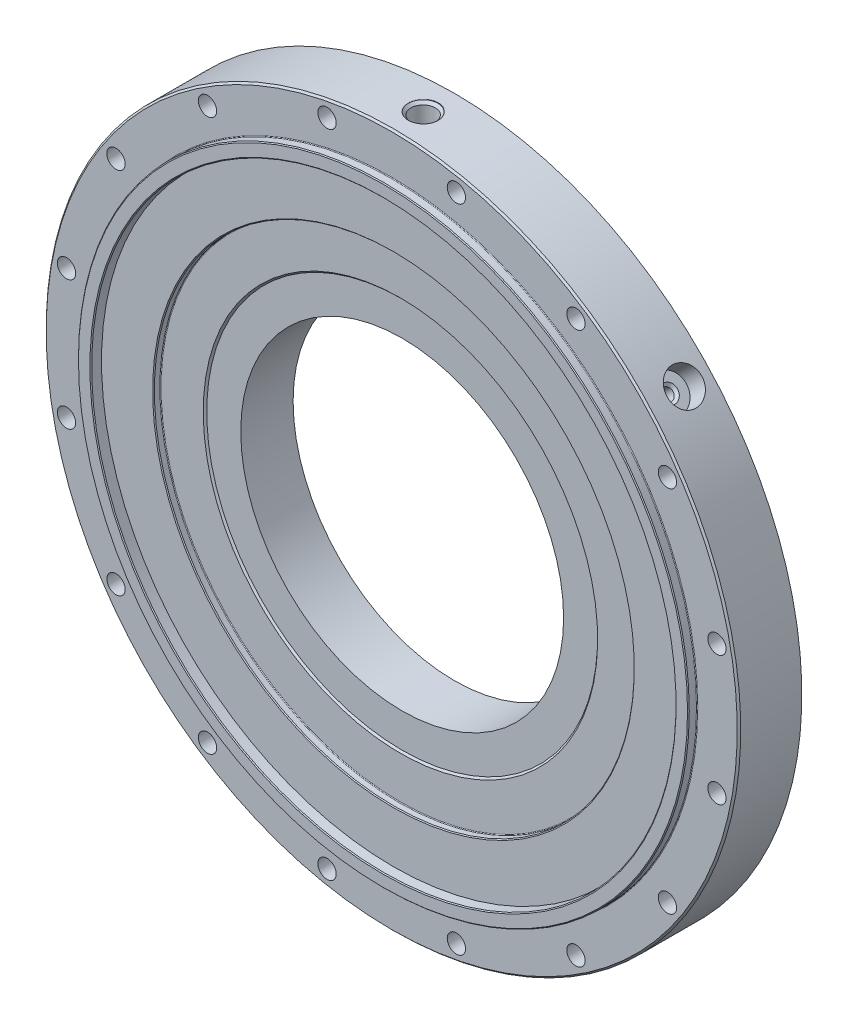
ISO-10303-21;
HEADER;
FILE_DESCRIPTION(('STEP AP214'),'2;1');
FILE_NAME('part.step','',(''),(''),'','','');
FILE_SCHEMA(('AUTOMOTIVE_DESIGN { 1 0 10303 214 1 1 1 1 }'));
ENDSEC;
DATA;
#1=APPLICATION_CONTEXT('core data for automotive mechanical design processes');
#2=APPLICATION_PROTOCOL_DEFINITION('international standard','automotive_design',2000,#1);
#3=PRODUCT_CONTEXT('',#1,'mechanical');
#4=PRODUCT('Part','Part','',(#3));
#5=PRODUCT_RELATED_PRODUCT_CATEGORY('part','',(#4));
#6=PRODUCT_DEFINITION_FORMATION('','',#4);
#7=PRODUCT_DEFINITION_CONTEXT('part definition',#1,'design');
#8=PRODUCT_DEFINITION('design','',#6,#7);
#9=PRODUCT_DEFINITION_SHAPE('','',#8);
#10=(LENGTH_UNIT() NAMED_UNIT(*) SI_UNIT(.MILLI.,.METRE.));
#11=(NAMED_UNIT(*) PLANE_ANGLE_UNIT() SI_UNIT($,.RADIAN.));
#12=(NAMED_UNIT(*) SI_UNIT($,.STERADIAN.) SOLID_ANGLE_UNIT());
#13=UNCERTAINTY_MEASURE_WITH_UNIT(LENGTH_MEASURE(1.E-05),#10,'distance_accuracy_value','');
#14=(GEOMETRIC_REPRESENTATION_CONTEXT(3) GLOBAL_UNCERTAINTY_ASSIGNED_CONTEXT((#13)) GLOBAL_UNIT_ASSIGNED_CONTEXT((#10,
#11,#12)) REPRESENTATION_CONTEXT('',''));
#15=CARTESIAN_POINT('',(0.,0.,0.));
#16=DIRECTION('',(0.,0.,1.));
#17=DIRECTION('',(1.,0.,0.));
#18=AXIS2_PLACEMENT_3D('',#15,#16,#17);
#19=CARTESIAN_POINT('',(0.,6.10865238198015E-07,35.));
#20=DIRECTION('',(0.,-1.74532925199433E-08,-1.));
#21=DIRECTION('',(0.,-1.,1.74532925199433E-08));
#22=AXIS2_PLACEMENT_3D('',#19,#20,#21);
#23=PLANE('',#22);
#24=CARTESIAN_POINT('',(0.,6.10865238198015E-07,35.));
#25=DIRECTION('',(0.,-1.74532925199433E-08,-1.));
#26=DIRECTION('',(0.,1.,-1.74532925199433E-08));
#27=AXIS2_PLACEMENT_3D('',#24,#25,#26);
#28=CIRCLE('',#27,167.290512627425);
#29=CARTESIAN_POINT('',(0.,-167.290512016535,35.0000029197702));
#30=VERTEX_POINT('',#29);
#31=EDGE_CURVE('E38',#30,#30,#28,.T.);
#32=ORIENTED_EDGE('',*,*,#31,.F.);
#33=EDGE_LOOP('',(#32));
#34=FACE_BOUND('',#33,.T.);
#35=CARTESIAN_POINT('',(0.,6.10865692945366E-07,35.));
#36=DIRECTION('',(0.,-1.74532925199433E-08,-1.));
#37=DIRECTION('',(0.,-1.,1.74532925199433E-08));
#38=AXIS2_PLACEMENT_3D('',#35,#36,#37);
#39=CIRCLE('',#38,137.999955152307);
#40=CARTESIAN_POINT('',(0.,-137.999954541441,35.0000024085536));
#41=VERTEX_POINT('',#40);
#42=EDGE_CURVE('E11',#41,#41,#39,.T.);
#43=ORIENTED_EDGE('',*,*,#42,.T.);
#44=EDGE_LOOP('',(#43));
#45=FACE_BOUND('',#44,.T.);
#46=ADVANCED_FACE('F16',(#34,#45),#23,.F.);
#47=CARTESIAN_POINT('',(0.,6.58864547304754E-07,37.75015783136));
#48=DIRECTION('',(0.,1.74532925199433E-08,1.));
#49=DIRECTION('',(0.,1.,-1.74532925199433E-08));
#50=AXIS2_PLACEMENT_3D('',#47,#48,#49);
#51=CONICAL_SURFACE('',#50,167.3625280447,0.0261799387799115);
#52=CARTESIAN_POINT('',(0.,7.06862272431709E-07,40.5002249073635));
#53=DIRECTION('',(0.,1.74532925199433E-08,1.));
#54=DIRECTION('',(0.,1.,-1.74532925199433E-08));
#55=AXIS2_PLACEMENT_3D('',#52,#53,#54);
#56=CIRCLE('',#55,167.434541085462);
#57=CARTESIAN_POINT('',(0.,167.434541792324,40.5002219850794));
#58=VERTEX_POINT('',#57);
#59=EDGE_CURVE('E31',#58,#58,#56,.T.);
#60=ORIENTED_EDGE('',*,*,#59,.T.);
#61=EDGE_LOOP('',(#60));
#62=FACE_BOUND('',#61,.T.);
#63=ORIENTED_EDGE('',*,*,#31,.T.);
#64=EDGE_LOOP('',(#63));
#65=FACE_BOUND('',#64,.T.);
#66=ADVANCED_FACE('F366',(#62,#65),#51,.F.);
#67=CARTESIAN_POINT('',(0.,7.11223633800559E-07,40.75011250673));
#68=DIRECTION('',(0.,1.74532925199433E-08,1.));
#69=DIRECTION('',(0.,-1.,1.74532925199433E-08));
#70=AXIS2_PLACEMENT_3D('',#67,#68,#69);
#71=CONICAL_SURFACE('',#70,167.6910577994,0.798487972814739);
#72=ORIENTED_EDGE('',*,*,#59,.F.);
#73=EDGE_LOOP('',(#72));
#74=FACE_BOUND('',#73,.T.);
#75=CARTESIAN_POINT('',(0.,7.15584993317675E-07,41.));
#76=DIRECTION('',(0.,1.74532925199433E-08,1.));
#77=DIRECTION('',(0.,-1.,1.74532925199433E-08));
#78=AXIS2_PLACEMENT_3D('',#75,#76,#77);
#79=CIRCLE('',#78,167.947574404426);
#80=CARTESIAN_POINT('',(0.,-167.947573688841,41.0000029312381));
#81=VERTEX_POINT('',#80);
#82=EDGE_CURVE('E434',#81,#81,#79,.T.);
#83=ORIENTED_EDGE('',*,*,#82,.T.);
#84=EDGE_LOOP('',(#83));
#85=FACE_BOUND('',#84,.T.);
#86=ADVANCED_FACE('F358',(#74,#85),#71,.F.);
#87=CARTESIAN_POINT('',(0.,7.15584993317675E-07,41.));
#88=DIRECTION('',(0.,-1.74532925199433E-08,-1.));
#89=DIRECTION('',(0.,-1.,1.74532925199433E-08));
#90=AXIS2_PLACEMENT_3D('',#87,#88,#89);
#91=PLANE('',#90);
#92=CARTESIAN_POINT('',(0.,7.15584993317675E-07,41.));
#93=DIRECTION('',(0.,-1.74532925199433E-08,-1.));
#94=DIRECTION('',(0.,-1.,1.74532925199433E-08));
#95=AXIS2_PLACEMENT_3D('',#92,#93,#94);
#96=CIRCLE('',#95,174.4999425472);
#97=CARTESIAN_POINT('',(0.,174.499943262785,40.9999969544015));
#98=VERTEX_POINT('',#97);
#99=EDGE_CURVE('E269',#98,#98,#96,.T.);
#100=ORIENTED_EDGE('',*,*,#99,.F.);
#101=EDGE_LOOP('',(#100));
#102=FACE_BOUND('',#101,.T.);
#103=ORIENTED_EDGE('',*,*,#82,.F.);
#104=EDGE_LOOP('',(#103));
#105=FACE_BOUND('',#104,.T.);
#106=ADVANCED_FACE('F354',(#102,#105),#91,.F.);
#107=CARTESIAN_POINT('',(0.,7.11221164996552E-07,40.74997105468));
#108=DIRECTION('',(0.,-1.74532925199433E-08,-1.));
#109=DIRECTION('',(0.,-1.,1.74532925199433E-08));
#110=AXIS2_PLACEMENT_3D('',#107,#108,#109);
#111=CONICAL_SURFACE('',#110,174.7499714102,0.7853979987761);
#112=CARTESIAN_POINT('',(0.,7.06857341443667E-07,40.4999423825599));
#113=DIRECTION('',(0.,-1.74532925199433E-08,-1.));
#114=DIRECTION('',(0.,-1.,1.74532925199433E-08));
#115=AXIS2_PLACEMENT_3D('',#112,#113,#114);
#116=CIRCLE('',#115,175.);
#117=CARTESIAN_POINT('',(0.,-174.999999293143,40.4999454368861));
#118=VERTEX_POINT('',#117);
#119=EDGE_CURVE('E270',#118,#118,#116,.T.);
#120=ORIENTED_EDGE('',*,*,#119,.F.);
#121=EDGE_LOOP('',(#120));
#122=FACE_BOUND('',#121,.T.);
#123=ORIENTED_EDGE('',*,*,#99,.T.);
#124=EDGE_LOOP('',(#123));
#125=FACE_BOUND('',#124,.T.);
#126=ADVANCED_FACE('F357',(#122,#125),#111,.T.);
#127=CARTESIAN_POINT('',(0.,8.5259333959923E-07,48.85));
#128=DIRECTION('',(0.,-1.74532925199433E-08,-1.));
#129=DIRECTION('',(0.,-1.,1.74532925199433E-08));
#130=AXIS2_PLACEMENT_3D('',#127,#128,#129);
#131=CYLINDRICAL_SURFACE('',#130,175.);
#132=CARTESIAN_POINT('',(0.,6.35299847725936E-07,36.4));
#133=DIRECTION('',(0.,1.74532925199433E-08,1.));
#134=DIRECTION('',(0.,-1.,1.74532925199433E-08));
#135=AXIS2_PLACEMENT_3D('',#132,#133,#134);
#136=CIRCLE('',#135,175.);
#137=CARTESIAN_POINT('',(0.,-174.9999993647,36.4000030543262));
#138=VERTEX_POINT('',#137);
#139=EDGE_CURVE('E266',#138,#138,#136,.T.);
#140=ORIENTED_EDGE('',*,*,#139,.T.);
#141=EDGE_LOOP('',(#140));
#142=FACE_BOUND('',#141,.T.);
#143=ORIENTED_EDGE('',*,*,#119,.T.);
#144=EDGE_LOOP('',(#143));
#145=FACE_BOUND('',#144,.T.);
#146=ADVANCED_FACE('F386',(#142,#145),#131,.T.);
#147=CARTESIAN_POINT('',(0.,6.35299847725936E-07,36.4));
#148=DIRECTION('',(0.,-1.74532925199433E-08,-1.));
#149=DIRECTION('',(0.00596866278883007,0.999982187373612,-1.74529816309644E-08));
#150=AXIS2_PLACEMENT_3D('',#147,#148,#149);
#151=TOROIDAL_SURFACE('',#150,175.4,0.4);
#152=CARTESIAN_POINT('',(0.,6.28318530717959E-07,36.));
#153=DIRECTION('',(0.,1.74532925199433E-08,1.));
#154=DIRECTION('',(-1.,0.,0.));
#155=AXIS2_PLACEMENT_3D('',#152,#153,#154);
#156=CIRCLE('',#155,175.4);
#157=CARTESIAN_POINT('',(0.,-175.399999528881,36.0000030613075));
#158=VERTEX_POINT('',#157);
#159=EDGE_CURVE('E497',#158,#158,#156,.T.);
#160=ORIENTED_EDGE('',*,*,#159,.T.);
#161=EDGE_LOOP('',(#160));
#162=FACE_BOUND('',#161,.T.);
#163=ORIENTED_EDGE('',*,*,#139,.F.);
#164=EDGE_LOOP('',(#163));
#165=FACE_BOUND('',#164,.T.);
#166=ADVANCED_FACE('F321',(#162,#165),#151,.F.);
#167=CARTESIAN_POINT('',(0.,6.28318530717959E-07,36.));
#168=DIRECTION('',(0.,-1.74532925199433E-08,-1.));
#169=DIRECTION('',(0.,-1.,1.74532925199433E-08));
#170=AXIS2_PLACEMENT_3D('',#167,#168,#169);
#171=PLANE('',#170);
#172=CARTESIAN_POINT('',(0.,6.28318530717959E-07,36.));
#173=DIRECTION('',(0.,-1.74532925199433E-08,-1.));
#174=DIRECTION('',(0.,-1.,1.74532925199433E-08));
#175=AXIS2_PLACEMENT_3D('',#172,#173,#174);
#176=CIRCLE('',#175,198.000000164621);
#177=CARTESIAN_POINT('',(0.,198.000000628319,35.9999965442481));
#178=VERTEX_POINT('',#177);
#179=EDGE_CURVE('E422',#178,#178,#176,.T.);
#180=ORIENTED_EDGE('',*,*,#179,.F.);
#181=EDGE_LOOP('',(#180));
#182=FACE_BOUND('',#181,.T.);
#183=CARTESIAN_POINT('',(37.06716118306,-186.349202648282,36.0000032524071));
#184=DIRECTION('',(0.,-1.74532925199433E-08,-1.));
#185=DIRECTION('',(-1.,0.,0.));
#186=AXIS2_PLACEMENT_3D('',#183,#184,#185);
#187=CIRCLE('',#186,5.25);
#188=CARTESIAN_POINT('',(31.81716118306,-186.349202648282,36.0000032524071));
#189=VERTEX_POINT('',#188);
#190=EDGE_CURVE('E498',#189,#189,#187,.T.);
#191=ORIENTED_EDGE('',*,*,#190,.T.);
#192=EDGE_LOOP('',(#191));
#193=FACE_BOUND('',#192,.T.);
#194=CARTESIAN_POINT('',(-37.06716118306,-186.349202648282,36.0000032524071));
#195=DIRECTION('',(0.,-1.74532925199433E-08,-1.));
#196=DIRECTION('',(-1.,0.,0.));
#197=AXIS2_PLACEMENT_3D('',#194,#195,#196);
#198=CIRCLE('',#197,5.25);
#199=CARTESIAN_POINT('',(-42.31716118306,-186.349202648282,36.0000032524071));
#200=VERTEX_POINT('',#199);
#201=EDGE_CURVE('E459',#200,#200,#198,.T.);
#202=ORIENTED_EDGE('',*,*,#201,.T.);
#203=EDGE_LOOP('',(#202));
#204=FACE_BOUND('',#203,.T.);
#205=CARTESIAN_POINT('',(-105.5583442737,-157.979225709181,36.0000027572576));
#206=DIRECTION('',(0.,-1.74532925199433E-08,-1.));
#207=DIRECTION('',(-1.,0.,0.));
#208=AXIS2_PLACEMENT_3D('',#205,#206,#207);
#209=CIRCLE('',#208,5.25);
#210=CARTESIAN_POINT('',(-110.8083442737,-157.979225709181,36.0000027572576));
#211=VERTEX_POINT('',#210);
#212=EDGE_CURVE('E456',#211,#211,#209,.T.);
#213=ORIENTED_EDGE('',*,*,#212,.T.);
#214=EDGE_LOOP('',(#213));
#215=FACE_BOUND('',#214,.T.);
#216=CARTESIAN_POINT('',(-157.9792263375,-105.558343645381,36.0000018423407));
#217=DIRECTION('',(0.,-1.74532925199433E-08,-1.));
#218=DIRECTION('',(-1.,0.,0.));
#219=AXIS2_PLACEMENT_3D('',#216,#217,#218);
#220=CIRCLE('',#219,5.25);
#221=CARTESIAN_POINT('',(-163.2292263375,-105.558343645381,36.0000018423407));
#222=VERTEX_POINT('',#221);
#223=EDGE_CURVE('E274',#222,#222,#220,.T.);
#224=ORIENTED_EDGE('',*,*,#223,.T.);
#225=EDGE_LOOP('',(#224));
#226=FACE_BOUND('',#225,.T.);
#227=CARTESIAN_POINT('',(-186.3492032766,-37.0671605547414,36.000000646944));
#228=DIRECTION('',(0.,-1.74532925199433E-08,-1.));
#229=DIRECTION('',(-1.,0.,0.));
#230=AXIS2_PLACEMENT_3D('',#227,#228,#229);
#231=CIRCLE('',#230,5.25);
#232=CARTESIAN_POINT('',(-191.5992032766,-37.0671605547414,36.000000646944));
#233=VERTEX_POINT('',#232);
#234=EDGE_CURVE('E271',#233,#233,#231,.T.);
#235=ORIENTED_EDGE('',*,*,#234,.T.);
#236=EDGE_LOOP('',(#235));
#237=FACE_BOUND('',#236,.T.);
#238=CARTESIAN_POINT('',(-186.3492032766,37.0671618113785,35.999999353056));
#239=DIRECTION('',(0.,-1.74532925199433E-08,-1.));
#240=DIRECTION('',(-1.,0.,0.));
#241=AXIS2_PLACEMENT_3D('',#238,#239,#240);
#242=CIRCLE('',#241,5.25);
#243=CARTESIAN_POINT('',(-191.5992032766,37.0671618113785,35.999999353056));
#244=VERTEX_POINT('',#243);
#245=EDGE_CURVE('E275',#244,#244,#242,.T.);
#246=ORIENTED_EDGE('',*,*,#245,.T.);
#247=EDGE_LOOP('',(#246));
#248=FACE_BOUND('',#247,.T.);
#249=CARTESIAN_POINT('',(-157.9792263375,105.558344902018,35.9999981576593));
#250=DIRECTION('',(0.,-1.74532925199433E-08,-1.));
#251=DIRECTION('',(-1.,0.,0.));
#252=AXIS2_PLACEMENT_3D('',#249,#250,#251);
#253=CIRCLE('',#252,5.25);
#254=CARTESIAN_POINT('',(-163.2292263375,105.558344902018,35.9999981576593));
#255=VERTEX_POINT('',#254);
#256=EDGE_CURVE('E284',#255,#255,#253,.T.);
#257=ORIENTED_EDGE('',*,*,#256,.T.);
#258=EDGE_LOOP('',(#257));
#259=FACE_BOUND('',#258,.T.);
#260=CARTESIAN_POINT('',(-105.5583442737,157.979226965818,35.9999972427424));
#261=DIRECTION('',(0.,-1.74532925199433E-08,-1.));
#262=DIRECTION('',(-1.,0.,0.));
#263=AXIS2_PLACEMENT_3D('',#260,#261,#262);
#264=CIRCLE('',#263,5.25);
#265=CARTESIAN_POINT('',(-110.8083442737,157.979226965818,35.9999972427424));
#266=VERTEX_POINT('',#265);
#267=EDGE_CURVE('E281',#266,#266,#264,.T.);
#268=ORIENTED_EDGE('',*,*,#267,.T.);
#269=EDGE_LOOP('',(#268));
#270=FACE_BOUND('',#269,.T.);
#271=CARTESIAN_POINT('',(-37.06716118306,186.349203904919,35.9999967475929));
#272=DIRECTION('',(0.,-1.74532925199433E-08,-1.));
#273=DIRECTION('',(-1.,0.,0.));
#274=AXIS2_PLACEMENT_3D('',#271,#272,#273);
#275=CIRCLE('',#274,5.25);
#276=CARTESIAN_POINT('',(-42.31716118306,186.349203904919,35.9999967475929));
#277=VERTEX_POINT('',#276);
#278=EDGE_CURVE('E285',#277,#277,#275,.T.);
#279=ORIENTED_EDGE('',*,*,#278,.T.);
#280=EDGE_LOOP('',(#279));
#281=FACE_BOUND('',#280,.T.);
#282=CARTESIAN_POINT('',(37.06716118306,186.349203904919,35.9999967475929));
#283=DIRECTION('',(0.,-1.74532925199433E-08,-1.));
#284=DIRECTION('',(-1.,0.,0.));
#285=AXIS2_PLACEMENT_3D('',#282,#283,#284);
#286=CIRCLE('',#285,5.25);
#287=CARTESIAN_POINT('',(31.81716118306,186.349203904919,35.9999967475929));
#288=VERTEX_POINT('',#287);
#289=EDGE_CURVE('E469',#288,#288,#286,.T.);
#290=ORIENTED_EDGE('',*,*,#289,.T.);
#291=EDGE_LOOP('',(#290));
#292=FACE_BOUND('',#291,.T.);
#293=CARTESIAN_POINT('',(105.5583442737,157.979226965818,35.9999972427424));
#294=DIRECTION('',(0.,-1.74532925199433E-08,-1.));
#295=DIRECTION('',(-1.,0.,0.));
#296=AXIS2_PLACEMENT_3D('',#293,#294,#295);
#297=CIRCLE('',#296,5.25);
#298=CARTESIAN_POINT('',(100.3083442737,157.979226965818,35.9999972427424));
#299=VERTEX_POINT('',#298);
#300=EDGE_CURVE('E260',#299,#299,#297,.T.);
#301=ORIENTED_EDGE('',*,*,#300,.T.);
#302=EDGE_LOOP('',(#301));
#303=FACE_BOUND('',#302,.T.);
#304=CARTESIAN_POINT('',(157.9792263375,105.558344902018,35.9999981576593));
#305=DIRECTION('',(0.,-1.74532925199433E-08,-1.));
#306=DIRECTION('',(-1.,0.,0.));
#307=AXIS2_PLACEMENT_3D('',#304,#305,#306);
#308=CIRCLE('',#307,5.25);
#309=CARTESIAN_POINT('',(152.7292263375,105.558344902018,35.9999981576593));
#310=VERTEX_POINT('',#309);
#311=EDGE_CURVE('E257',#310,#310,#308,.T.);
#312=ORIENTED_EDGE('',*,*,#311,.T.);
#313=EDGE_LOOP('',(#312));
#314=FACE_BOUND('',#313,.T.);
#315=CARTESIAN_POINT('',(186.3492032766,37.0671618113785,35.999999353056));
#316=DIRECTION('',(0.,-1.74532925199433E-08,-1.));
#317=DIRECTION('',(-1.,0.,0.));
#318=AXIS2_PLACEMENT_3D('',#315,#316,#317);
#319=CIRCLE('',#318,5.25);
#320=CARTESIAN_POINT('',(181.0992032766,37.0671618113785,35.999999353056));
#321=VERTEX_POINT('',#320);
#322=EDGE_CURVE('E261',#321,#321,#319,.T.);
#323=ORIENTED_EDGE('',*,*,#322,.T.);
#324=EDGE_LOOP('',(#323));
#325=FACE_BOUND('',#324,.T.);
#326=CARTESIAN_POINT('',(186.3492032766,-37.0671605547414,36.000000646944));
#327=DIRECTION('',(0.,-1.74532925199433E-08,-1.));
#328=DIRECTION('',(-1.,0.,0.));
#329=AXIS2_PLACEMENT_3D('',#326,#327,#328);
#330=CIRCLE('',#329,5.25);
#331=CARTESIAN_POINT('',(181.0992032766,-37.0671605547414,36.000000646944));
#332=VERTEX_POINT('',#331);
#333=EDGE_CURVE('E455',#332,#332,#330,.T.);
#334=ORIENTED_EDGE('',*,*,#333,.T.);
#335=EDGE_LOOP('',(#334));
#336=FACE_BOUND('',#335,.T.);
#337=CARTESIAN_POINT('',(157.9792263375,-105.558343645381,36.0000018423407));
#338=DIRECTION('',(0.,-1.74532925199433E-08,-1.));
#339=DIRECTION('',(-1.,0.,0.));
#340=AXIS2_PLACEMENT_3D('',#337,#338,#339);
#341=CIRCLE('',#340,5.25);
#342=CARTESIAN_POINT('',(152.7292263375,-105.558343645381,36.0000018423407));
#343=VERTEX_POINT('',#342);
#344=EDGE_CURVE('E462',#343,#343,#341,.T.);
#345=ORIENTED_EDGE('',*,*,#344,.T.);
#346=EDGE_LOOP('',(#345));
#347=FACE_BOUND('',#346,.T.);
#348=CARTESIAN_POINT('',(105.5583442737,-157.979225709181,36.0000027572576));
#349=DIRECTION('',(0.,-1.74532925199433E-08,-1.));
#350=DIRECTION('',(-1.,0.,0.));
#351=AXIS2_PLACEMENT_3D('',#348,#349,#350);
#352=CIRCLE('',#351,5.25);
#353=CARTESIAN_POINT('',(100.3083442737,-157.979225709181,36.0000027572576));
#354=VERTEX_POINT('',#353);
#355=EDGE_CURVE('E279',#354,#354,#352,.T.);
#356=ORIENTED_EDGE('',*,*,#355,.T.);
#357=EDGE_LOOP('',(#356));
#358=FACE_BOUND('',#357,.T.);
#359=ORIENTED_EDGE('',*,*,#159,.F.);
#360=EDGE_LOOP('',(#359));
#361=FACE_BOUND('',#360,.T.);
#362=ADVANCED_FACE('F377',(#182,#193,#204,#215,#226,#237,#248,#259,#270,#281,#292,#303,#314,
#325,#336,#347,#358,#361),#171,.F.);
#363=CARTESIAN_POINT('',(37.06716118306,-186.349202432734,48.3500032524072));
#364=DIRECTION('',(0.,-1.74532925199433E-08,-1.));
#365=DIRECTION('',(-1.,0.,0.));
#366=AXIS2_PLACEMENT_3D('',#363,#364,#365);
#367=CYLINDRICAL_SURFACE('',#366,5.25);
#368=ORIENTED_EDGE('',*,*,#190,.F.);
#369=EDGE_LOOP('',(#368));
#370=FACE_BOUND('',#369,.T.);
#371=CARTESIAN_POINT('',(37.06716118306,-186.3492032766,3.25240715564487E-06));
#372=DIRECTION('',(0.,-1.74532925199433E-08,-1.));
#373=DIRECTION('',(-1.,0.,0.));
#374=AXIS2_PLACEMENT_3D('',#371,#372,#373);
#375=CIRCLE('',#374,5.25);
#376=CARTESIAN_POINT('',(42.31716118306,-186.3492032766,3.25240715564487E-06));
#377=VERTEX_POINT('',#376);
#378=EDGE_CURVE('E276',#377,#377,#375,.T.);
#379=ORIENTED_EDGE('',*,*,#378,.T.);
#380=EDGE_LOOP('',(#379));
#381=FACE_BOUND('',#380,.T.);
#382=ADVANCED_FACE('F373',(#370,#381),#367,.F.);
#383=CARTESIAN_POINT('',(0.,0.,0.));
#384=DIRECTION('',(0.,-1.74532925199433E-08,-1.));
#385=DIRECTION('',(0.,-1.,1.74532925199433E-08));
#386=AXIS2_PLACEMENT_3D('',#383,#384,#385);
#387=PLANE('',#386);
#388=CARTESIAN_POINT('',(0.,0.,0.));
#389=DIRECTION('',(0.,-1.74532925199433E-08,-1.));
#390=DIRECTION('',(0.,-1.,1.74532925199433E-08));
#391=AXIS2_PLACEMENT_3D('',#388,#389,#390);
#392=CIRCLE('',#391,199.);
#393=CARTESIAN_POINT('',(0.,199.,-3.47320521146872E-06));
#394=VERTEX_POINT('',#393);
#395=EDGE_CURVE('E280',#394,#394,#392,.T.);
#396=ORIENTED_EDGE('',*,*,#395,.T.);
#397=EDGE_LOOP('',(#396));
#398=FACE_BOUND('',#397,.T.);
#399=CARTESIAN_POINT('',(0.,0.,0.));
#400=DIRECTION('',(0.,-1.74532925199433E-08,-1.));
#401=DIRECTION('',(0.,-1.,1.74532925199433E-08));
#402=AXIS2_PLACEMENT_3D('',#399,#400,#401);
#403=CIRCLE('',#402,92.5);
#404=CARTESIAN_POINT('',(0.,-92.5,1.61442955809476E-06));
#405=VERTEX_POINT('',#404);
#406=EDGE_CURVE('E443',#405,#405,#403,.T.);
#407=ORIENTED_EDGE('',*,*,#406,.F.);
#408=EDGE_LOOP('',(#407));
#409=FACE_BOUND('',#408,.T.);
#410=ORIENTED_EDGE('',*,*,#378,.F.);
#411=EDGE_LOOP('',(#410));
#412=FACE_BOUND('',#411,.T.);
#413=CARTESIAN_POINT('',(-37.06716118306,-186.3492032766,3.25240715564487E-06));
#414=DIRECTION('',(0.,-1.74532925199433E-08,-1.));
#415=DIRECTION('',(-1.,0.,0.));
#416=AXIS2_PLACEMENT_3D('',#413,#414,#415);
#417=CIRCLE('',#416,5.25);
#418=CARTESIAN_POINT('',(-42.31716118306,-186.3492032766,3.25240715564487E-06));
#419=VERTEX_POINT('',#418);
#420=EDGE_CURVE('E286',#419,#419,#417,.T.);
#421=ORIENTED_EDGE('',*,*,#420,.F.);
#422=EDGE_LOOP('',(#421));
#423=FACE_BOUND('',#422,.T.);
#424=CARTESIAN_POINT('',(-105.5583442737,-157.9792263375,2.75725764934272E-06));
#425=DIRECTION('',(0.,-1.74532925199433E-08,-1.));
#426=DIRECTION('',(-1.,0.,0.));
#427=AXIS2_PLACEMENT_3D('',#424,#425,#426);
#428=CIRCLE('',#427,5.25);
#429=CARTESIAN_POINT('',(-110.8083442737,-157.9792263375,2.75725764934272E-06));
#430=VERTEX_POINT('',#429);
#431=EDGE_CURVE('E290',#430,#430,#428,.T.);
#432=ORIENTED_EDGE('',*,*,#431,.F.);
#433=EDGE_LOOP('',(#432));
#434=FACE_BOUND('',#433,.T.);
#435=CARTESIAN_POINT('',(-157.9792263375,-105.5583442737,1.84234066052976E-06));
#436=DIRECTION('',(0.,-1.74532925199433E-08,-1.));
#437=DIRECTION('',(-1.,0.,0.));
#438=AXIS2_PLACEMENT_3D('',#435,#436,#437);
#439=CIRCLE('',#438,5.25);
#440=CARTESIAN_POINT('',(-163.2292263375,-105.5583442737,1.84234066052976E-06));
#441=VERTEX_POINT('',#440);
#442=EDGE_CURVE('E291',#441,#441,#439,.T.);
#443=ORIENTED_EDGE('',*,*,#442,.F.);
#444=EDGE_LOOP('',(#443));
#445=FACE_BOUND('',#444,.T.);
#446=CARTESIAN_POINT('',(-186.3492032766,-37.06716118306,6.46944007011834E-07));
#447=DIRECTION('',(0.,-1.74532925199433E-08,-1.));
#448=DIRECTION('',(-1.,0.,0.));
#449=AXIS2_PLACEMENT_3D('',#446,#447,#448);
#450=CIRCLE('',#449,5.25);
#451=CARTESIAN_POINT('',(-191.5992032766,-37.06716118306,6.46944007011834E-07));
#452=VERTEX_POINT('',#451);
#453=EDGE_CURVE('E245',#452,#452,#450,.T.);
#454=ORIENTED_EDGE('',*,*,#453,.F.);
#455=EDGE_LOOP('',(#454));
#456=FACE_BOUND('',#455,.T.);
#457=CARTESIAN_POINT('',(-186.3492032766,37.06716118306,-6.46944007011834E-07));
#458=DIRECTION('',(0.,-1.74532925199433E-08,-1.));
#459=DIRECTION('',(-1.,0.,0.));
#460=AXIS2_PLACEMENT_3D('',#457,#458,#459);
#461=CIRCLE('',#460,5.25);
#462=CARTESIAN_POINT('',(-191.5992032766,37.06716118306,-6.46944007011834E-07));
#463=VERTEX_POINT('',#462);
#464=EDGE_CURVE('E465',#463,#463,#461,.T.);
#465=ORIENTED_EDGE('',*,*,#464,.F.);
#466=EDGE_LOOP('',(#465));
#467=FACE_BOUND('',#466,.T.);
#468=CARTESIAN_POINT('',(-157.9792263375,105.5583442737,-1.84234066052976E-06));
#469=DIRECTION('',(0.,-1.74532925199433E-08,-1.));
#470=DIRECTION('',(-1.,0.,0.));
#471=AXIS2_PLACEMENT_3D('',#468,#469,#470);
#472=CIRCLE('',#471,5.25);
#473=CARTESIAN_POINT('',(-163.2292263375,105.5583442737,-1.84234066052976E-06));
#474=VERTEX_POINT('',#473);
#475=EDGE_CURVE('E449',#474,#474,#472,.T.);
#476=ORIENTED_EDGE('',*,*,#475,.F.);
#477=EDGE_LOOP('',(#476));
#478=FACE_BOUND('',#477,.T.);
#479=CARTESIAN_POINT('',(-105.5583442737,157.9792263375,-2.75725764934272E-06));
#480=DIRECTION('',(0.,-1.74532925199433E-08,-1.));
#481=DIRECTION('',(-1.,0.,0.));
#482=AXIS2_PLACEMENT_3D('',#479,#480,#481);
#483=CIRCLE('',#482,5.25);
#484=CARTESIAN_POINT('',(-110.8083442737,157.9792263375,-2.75725764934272E-06));
#485=VERTEX_POINT('',#484);
#486=EDGE_CURVE('E446',#485,#485,#483,.T.);
#487=ORIENTED_EDGE('',*,*,#486,.F.);
#488=EDGE_LOOP('',(#487));
#489=FACE_BOUND('',#488,.T.);
#490=CARTESIAN_POINT('',(-37.06716118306,186.3492032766,-3.25240715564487E-06));
#491=DIRECTION('',(0.,-1.74532925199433E-08,-1.));
#492=DIRECTION('',(-1.,0.,0.));
#493=AXIS2_PLACEMENT_3D('',#490,#491,#492);
#494=CIRCLE('',#493,5.25);
#495=CARTESIAN_POINT('',(-42.31716118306,186.3492032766,-3.25240715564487E-06));
#496=VERTEX_POINT('',#495);
#497=EDGE_CURVE('E299',#496,#496,#494,.T.);
#498=ORIENTED_EDGE('',*,*,#497,.F.);
#499=EDGE_LOOP('',(#498));
#500=FACE_BOUND('',#499,.T.);
#501=CARTESIAN_POINT('',(37.06716118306,186.3492032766,-3.25240715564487E-06));
#502=DIRECTION('',(0.,-1.74532925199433E-08,-1.));
#503=DIRECTION('',(-1.,0.,0.));
#504=AXIS2_PLACEMENT_3D('',#501,#502,#503);
#505=CIRCLE('',#504,5.25);
#506=CARTESIAN_POINT('',(31.81716118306,186.3492032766,-3.25240715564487E-06));
#507=VERTEX_POINT('',#506);
#508=EDGE_CURVE('E296',#507,#507,#505,.T.);
#509=ORIENTED_EDGE('',*,*,#508,.F.);
#510=EDGE_LOOP('',(#509));
#511=FACE_BOUND('',#510,.T.);
#512=CARTESIAN_POINT('',(105.5583442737,157.9792263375,-2.75725764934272E-06));
#513=DIRECTION('',(0.,-1.74532925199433E-08,-1.));
#514=DIRECTION('',(-1.,0.,0.));
#515=AXIS2_PLACEMENT_3D('',#512,#513,#514);
#516=CIRCLE('',#515,5.25);
#517=CARTESIAN_POINT('',(100.3083442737,157.9792263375,-2.75725764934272E-06));
#518=VERTEX_POINT('',#517);
#519=EDGE_CURVE('E300',#518,#518,#516,.T.);
#520=ORIENTED_EDGE('',*,*,#519,.F.);
#521=EDGE_LOOP('',(#520));
#522=FACE_BOUND('',#521,.T.);
#523=CARTESIAN_POINT('',(157.9792263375,105.5583442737,-1.84234066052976E-06));
#524=DIRECTION('',(0.,-1.74532925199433E-08,-1.));
#525=DIRECTION('',(-1.,0.,0.));
#526=AXIS2_PLACEMENT_3D('',#523,#524,#525);
#527=CIRCLE('',#526,5.25);
#528=CARTESIAN_POINT('',(152.7292263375,105.5583442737,-1.84234066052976E-06));
#529=VERTEX_POINT('',#528);
#530=EDGE_CURVE('E255',#529,#529,#527,.T.);
#531=ORIENTED_EDGE('',*,*,#530,.F.);
#532=EDGE_LOOP('',(#531));
#533=FACE_BOUND('',#532,.T.);
#534=CARTESIAN_POINT('',(186.3492032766,37.06716118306,-6.46944007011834E-07));
#535=DIRECTION('',(0.,-1.74532925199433E-08,-1.));
#536=DIRECTION('',(-1.,0.,0.));
#537=AXIS2_PLACEMENT_3D('',#534,#535,#536);
#538=CIRCLE('',#537,5.25);
#539=CARTESIAN_POINT('',(181.0992032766,37.06716118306,-6.46944007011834E-07));
#540=VERTEX_POINT('',#539);
#541=EDGE_CURVE('E252',#540,#540,#538,.T.);
#542=ORIENTED_EDGE('',*,*,#541,.F.);
#543=EDGE_LOOP('',(#542));
#544=FACE_BOUND('',#543,.T.);
#545=CARTESIAN_POINT('',(186.3492032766,-37.06716118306,6.46944007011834E-07));
#546=DIRECTION('',(0.,-1.74532925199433E-08,-1.));
#547=DIRECTION('',(-1.,0.,0.));
#548=AXIS2_PLACEMENT_3D('',#545,#546,#547);
#549=CIRCLE('',#548,5.25);
#550=CARTESIAN_POINT('',(181.0992032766,-37.06716118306,6.46944007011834E-07));
#551=VERTEX_POINT('',#550);
#552=EDGE_CURVE('E256',#551,#551,#549,.T.);
#553=ORIENTED_EDGE('',*,*,#552,.F.);
#554=EDGE_LOOP('',(#553));
#555=FACE_BOUND('',#554,.T.);
#556=CARTESIAN_POINT('',(157.9792263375,-105.5583442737,1.84234066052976E-06));
#557=DIRECTION('',(0.,-1.74532925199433E-08,-1.));
#558=DIRECTION('',(-1.,0.,0.));
#559=AXIS2_PLACEMENT_3D('',#556,#557,#558);
#560=CIRCLE('',#559,5.25);
#561=CARTESIAN_POINT('',(152.7292263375,-105.5583442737,1.84234066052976E-06));
#562=VERTEX_POINT('',#561);
#563=EDGE_CURVE('E488',#562,#562,#560,.T.);
#564=ORIENTED_EDGE('',*,*,#563,.F.);
#565=EDGE_LOOP('',(#564));
#566=FACE_BOUND('',#565,.T.);
#567=CARTESIAN_POINT('',(105.5583442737,-157.9792263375,2.75725764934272E-06));
#568=DIRECTION('',(0.,-1.74532925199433E-08,-1.));
#569=DIRECTION('',(-1.,0.,0.));
#570=AXIS2_PLACEMENT_3D('',#567,#568,#569);
#571=CIRCLE('',#570,5.25);
#572=CARTESIAN_POINT('',(100.3083442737,-157.9792263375,2.75725764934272E-06));
#573=VERTEX_POINT('',#572);
#574=EDGE_CURVE('E307',#573,#573,#571,.T.);
#575=ORIENTED_EDGE('',*,*,#574,.F.);
#576=EDGE_LOOP('',(#575));
#577=FACE_BOUND('',#576,.T.);
#578=ADVANCED_FACE('F376',(#398,#409,#412,#423,#434,#445,#456,#467,#478,#489,#500,#511,#522,
#533,#544,#555,#566,#577),#387,.T.);
#579=CARTESIAN_POINT('',(0.,7.8801615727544E-07,45.15));
#580=DIRECTION('',(0.,-1.74532925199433E-08,-1.));
#581=DIRECTION('',(0.,-1.,1.74532925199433E-08));
#582=AXIS2_PLACEMENT_3D('',#579,#580,#581);
#583=CYLINDRICAL_SURFACE('',#582,92.5);
#584=CARTESIAN_POINT('',(0.,5.23598775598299E-07,30.));
#585=DIRECTION('',(0.,-1.74532925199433E-08,-1.));
#586=DIRECTION('',(0.,-1.,1.74532925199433E-08));
#587=AXIS2_PLACEMENT_3D('',#584,#585,#586);
#588=CIRCLE('',#587,92.5);
#589=CARTESIAN_POINT('',(0.,92.5000005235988,29.9999983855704));
#590=VERTEX_POINT('',#589);
#591=EDGE_CURVE('E438',#590,#590,#588,.T.);
#592=ORIENTED_EDGE('',*,*,#591,.F.);
#593=EDGE_LOOP('',(#592));
#594=FACE_BOUND('',#593,.T.);
#595=ORIENTED_EDGE('',*,*,#406,.T.);
#596=EDGE_LOOP('',(#595));
#597=FACE_BOUND('',#596,.T.);
#598=ADVANCED_FACE('F334',(#594,#597),#583,.F.);
#599=CARTESIAN_POINT('',(0.,5.23598775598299E-07,30.));
#600=DIRECTION('',(0.,-1.74532925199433E-08,-1.));
#601=DIRECTION('',(0.,-1.,1.74532925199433E-08));
#602=AXIS2_PLACEMENT_3D('',#599,#600,#601);
#603=PLANE('',#602);
#604=CARTESIAN_POINT('',(0.,5.23598775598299E-07,30.));
#605=DIRECTION('',(0.,1.74532925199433E-08,1.));
#606=DIRECTION('',(0.,1.,-1.74532925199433E-08));
#607=AXIS2_PLACEMENT_3D('',#604,#605,#606);
#608=CIRCLE('',#607,112.000000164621);
#609=CARTESIAN_POINT('',(0.,-111.999999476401,30.0000019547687));
#610=VERTEX_POINT('',#609);
#611=EDGE_CURVE('E440',#610,#610,#608,.T.);
#612=ORIENTED_EDGE('',*,*,#611,.T.);
#613=EDGE_LOOP('',(#612));
#614=FACE_BOUND('',#613,.T.);
#615=ORIENTED_EDGE('',*,*,#591,.T.);
#616=EDGE_LOOP('',(#615));
#617=FACE_BOUND('',#616,.T.);
#618=ADVANCED_FACE('F330',(#614,#617),#603,.F.);
#619=CARTESIAN_POINT('',(0.,5.32325421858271E-07,30.5));
#620=DIRECTION('',(0.,1.74532925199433E-08,1.));
#621=DIRECTION('',(0.,1.,-1.74532925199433E-08));
#622=AXIS2_PLACEMENT_3D('',#619,#620,#621);
#623=CONICAL_SURFACE('',#622,112.5,0.7853979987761);
#624=CARTESIAN_POINT('',(0.,5.41052068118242E-07,31.));
#625=DIRECTION('',(0.,-1.74532925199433E-08,-1.));
#626=DIRECTION('',(0.,1.,-1.74532925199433E-08));
#627=AXIS2_PLACEMENT_3D('',#624,#625,#626);
#628=CIRCLE('',#627,112.999999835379);
#629=CARTESIAN_POINT('',(0.,113.000000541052,30.999998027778));
#630=VERTEX_POINT('',#629);
#631=EDGE_CURVE('E439',#630,#630,#628,.T.);
#632=ORIENTED_EDGE('',*,*,#631,.F.);
#633=EDGE_LOOP('',(#632));
#634=FACE_BOUND('',#633,.T.);
#635=ORIENTED_EDGE('',*,*,#611,.F.);
#636=EDGE_LOOP('',(#635));
#637=FACE_BOUND('',#636,.T.);
#638=ADVANCED_FACE('F333',(#634,#637),#623,.F.);
#639=CARTESIAN_POINT('',(0.,5.41052068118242E-07,31.));
#640=DIRECTION('',(0.,-1.74532925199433E-08,-1.));
#641=DIRECTION('',(0.,-1.,1.74532925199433E-08));
#642=AXIS2_PLACEMENT_3D('',#639,#640,#641);
#643=PLANE('',#642);
#644=CARTESIAN_POINT('',(0.,5.41052068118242E-07,31.));
#645=DIRECTION('',(0.,1.74532925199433E-08,1.));
#646=DIRECTION('',(-1.,0.,0.));
#647=AXIS2_PLACEMENT_3D('',#644,#645,#646);
#648=CIRCLE('',#647,137.1);
#649=CARTESIAN_POINT('',(0.,-137.099999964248,31.0000023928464));
#650=VERTEX_POINT('',#649);
#651=EDGE_CURVE('E435',#650,#650,#648,.T.);
#652=ORIENTED_EDGE('',*,*,#651,.T.);
#653=EDGE_LOOP('',(#652));
#654=FACE_BOUND('',#653,.T.);
#655=ORIENTED_EDGE('',*,*,#631,.T.);
#656=EDGE_LOOP('',(#655));
#657=FACE_BOUND('',#656,.T.);
#658=ADVANCED_FACE('F579',(#654,#657),#643,.F.);
#659=CARTESIAN_POINT('',(0.,5.48033385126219E-07,31.4));
#660=DIRECTION('',(0.,-1.74532925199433E-08,-1.));
#661=DIRECTION('',(0.00514181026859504,0.999986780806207,-1.74530618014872E-08));
#662=AXIS2_PLACEMENT_3D('',#659,#660,#661);
#663=TOROIDAL_SURFACE('',#662,137.1,0.4);
#664=CARTESIAN_POINT('',(0.,5.48033385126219E-07,31.4));
#665=DIRECTION('',(0.,1.74532925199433E-08,1.));
#666=DIRECTION('',(0.,-1.,1.74532925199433E-08));
#667=AXIS2_PLACEMENT_3D('',#664,#665,#666);
#668=CIRCLE('',#667,137.5);
#669=CARTESIAN_POINT('',(0.,-137.499999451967,31.4000023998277));
#670=VERTEX_POINT('',#669);
#671=EDGE_CURVE('E450',#670,#670,#668,.T.);
#672=ORIENTED_EDGE('',*,*,#671,.T.);
#673=EDGE_LOOP('',(#672));
#674=FACE_BOUND('',#673,.T.);
#675=ORIENTED_EDGE('',*,*,#651,.F.);
#676=EDGE_LOOP('',(#675));
#677=FACE_BOUND('',#676,.T.);
#678=ADVANCED_FACE('F364',(#674,#677),#663,.F.);
#679=CARTESIAN_POINT('',(0.,8.5259333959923E-07,48.85));
#680=DIRECTION('',(0.,-1.74532925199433E-08,-1.));
#681=DIRECTION('',(0.,-1.,1.74532925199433E-08));
#682=AXIS2_PLACEMENT_3D('',#679,#680,#681);
#683=CYLINDRICAL_SURFACE('',#682,137.5);
#684=ORIENTED_EDGE('',*,*,#671,.F.);
#685=EDGE_LOOP('',(#684));
#686=FACE_BOUND('',#685,.T.);
#687=CARTESIAN_POINT('',(0.,6.02139371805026E-07,34.5000446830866));
#688=DIRECTION('',(0.,-1.74532925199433E-08,-1.));
#689=DIRECTION('',(0.,-1.,1.74532925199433E-08));
#690=AXIS2_PLACEMENT_3D('',#687,#688,#689);
#691=CIRCLE('',#690,137.5);
#692=CARTESIAN_POINT('',(0.,137.500000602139,34.5000422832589));
#693=VERTEX_POINT('',#692);
#694=EDGE_CURVE('E289',#693,#693,#691,.T.);
#695=ORIENTED_EDGE('',*,*,#694,.F.);
#696=EDGE_LOOP('',(#695));
#697=FACE_BOUND('',#696,.T.);
#698=ADVANCED_FACE('F360',(#686,#697),#683,.F.);
#699=CARTESIAN_POINT('',(0.,6.06502760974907E-07,34.75002241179));
#700=DIRECTION('',(0.,1.74532925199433E-08,1.));
#701=DIRECTION('',(0.,-1.,1.74532925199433E-08));
#702=AXIS2_PLACEMENT_3D('',#699,#700,#701);
#703=CONICAL_SURFACE('',#702,137.7499776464,0.7853979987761);
#704=ORIENTED_EDGE('',*,*,#42,.F.);
#705=EDGE_LOOP('',(#704));
#706=FACE_BOUND('',#705,.T.);
#707=ORIENTED_EDGE('',*,*,#694,.T.);
#708=EDGE_LOOP('',(#707));
#709=FACE_BOUND('',#708,.T.);
#710=ADVANCED_FACE('F363',(#706,#709),#703,.F.);
#711=CARTESIAN_POINT('',(-37.06716118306,-186.349202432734,48.3500032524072));
#712=DIRECTION('',(0.,-1.74532925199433E-08,-1.));
#713=DIRECTION('',(-1.,0.,0.));
#714=AXIS2_PLACEMENT_3D('',#711,#712,#713);
#715=CYLINDRICAL_SURFACE('',#714,5.25);
#716=ORIENTED_EDGE('',*,*,#201,.F.);
#717=EDGE_LOOP('',(#716));
#718=FACE_BOUND('',#717,.T.);
#719=ORIENTED_EDGE('',*,*,#420,.T.);
#720=EDGE_LOOP('',(#719));
#721=FACE_BOUND('',#720,.T.);
#722=ADVANCED_FACE('F381',(#718,#721),#715,.F.);
#723=CARTESIAN_POINT('',(-105.5583442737,-157.979225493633,48.3500027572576));
#724=DIRECTION('',(0.,-1.74532925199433E-08,-1.));
#725=DIRECTION('',(-1.,0.,0.));
#726=AXIS2_PLACEMENT_3D('',#723,#724,#725);
#727=CYLINDRICAL_SURFACE('',#726,5.25);
#728=ORIENTED_EDGE('',*,*,#212,.F.);
#729=EDGE_LOOP('',(#728));
#730=FACE_BOUND('',#729,.T.);
#731=ORIENTED_EDGE('',*,*,#431,.T.);
#732=EDGE_LOOP('',(#731));
#733=FACE_BOUND('',#732,.T.);
#734=ADVANCED_FACE('F352',(#730,#733),#727,.F.);
#735=CARTESIAN_POINT('',(-157.9792263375,-105.558343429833,48.3500018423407));
#736=DIRECTION('',(0.,-1.74532925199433E-08,-1.));
#737=DIRECTION('',(-1.,0.,0.));
#738=AXIS2_PLACEMENT_3D('',#735,#736,#737);
#739=CYLINDRICAL_SURFACE('',#738,5.25);
#740=ORIENTED_EDGE('',*,*,#223,.F.);
#741=EDGE_LOOP('',(#740));
#742=FACE_BOUND('',#741,.T.);
#743=ORIENTED_EDGE('',*,*,#442,.T.);
#744=EDGE_LOOP('',(#743));
#745=FACE_BOUND('',#744,.T.);
#746=ADVANCED_FACE('F348',(#742,#745),#739,.F.);
#747=CARTESIAN_POINT('',(-186.3492032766,-37.0671603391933,48.350000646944));
#748=DIRECTION('',(0.,-1.74532925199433E-08,-1.));
#749=DIRECTION('',(-1.,0.,0.));
#750=AXIS2_PLACEMENT_3D('',#747,#748,#749);
#751=CYLINDRICAL_SURFACE('',#750,5.25);
#752=ORIENTED_EDGE('',*,*,#234,.F.);
#753=EDGE_LOOP('',(#752));
#754=FACE_BOUND('',#753,.T.);
#755=ORIENTED_EDGE('',*,*,#453,.T.);
#756=EDGE_LOOP('',(#755));
#757=FACE_BOUND('',#756,.T.);
#758=ADVANCED_FACE('F351',(#754,#757),#751,.F.);
#759=CARTESIAN_POINT('',(-186.3492032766,37.0671620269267,48.349999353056));
#760=DIRECTION('',(0.,-1.74532925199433E-08,-1.));
#761=DIRECTION('',(-1.,0.,0.));
#762=AXIS2_PLACEMENT_3D('',#759,#760,#761);
#763=CYLINDRICAL_SURFACE('',#762,5.25);
#764=ORIENTED_EDGE('',*,*,#245,.F.);
#765=EDGE_LOOP('',(#764));
#766=FACE_BOUND('',#765,.T.);
#767=ORIENTED_EDGE('',*,*,#464,.T.);
#768=EDGE_LOOP('',(#767));
#769=FACE_BOUND('',#768,.T.);
#770=ADVANCED_FACE('F390',(#766,#769),#763,.F.);
#771=CARTESIAN_POINT('',(-157.9792263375,105.558345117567,48.3499981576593));
#772=DIRECTION('',(0.,-1.74532925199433E-08,-1.));
#773=DIRECTION('',(-1.,0.,0.));
#774=AXIS2_PLACEMENT_3D('',#771,#772,#773);
#775=CYLINDRICAL_SURFACE('',#774,5.25);
#776=ORIENTED_EDGE('',*,*,#256,.F.);
#777=EDGE_LOOP('',(#776));
#778=FACE_BOUND('',#777,.T.);
#779=ORIENTED_EDGE('',*,*,#475,.T.);
#780=EDGE_LOOP('',(#779));
#781=FACE_BOUND('',#780,.T.);
#782=ADVANCED_FACE('F393',(#778,#781),#775,.F.);
#783=CARTESIAN_POINT('',(-105.5583442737,157.979227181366,48.3499972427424));
#784=DIRECTION('',(0.,-1.74532925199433E-08,-1.));
#785=DIRECTION('',(-1.,0.,0.));
#786=AXIS2_PLACEMENT_3D('',#783,#784,#785);
#787=CYLINDRICAL_SURFACE('',#786,5.25);
#788=ORIENTED_EDGE('',*,*,#267,.F.);
#789=EDGE_LOOP('',(#788));
#790=FACE_BOUND('',#789,.T.);
#791=ORIENTED_EDGE('',*,*,#486,.T.);
#792=EDGE_LOOP('',(#791));
#793=FACE_BOUND('',#792,.T.);
#794=ADVANCED_FACE('F398',(#790,#793),#787,.F.);
#795=CARTESIAN_POINT('',(-37.06716118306,186.349204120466,48.3499967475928));
#796=DIRECTION('',(0.,-1.74532925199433E-08,-1.));
#797=DIRECTION('',(-1.,0.,0.));
#798=AXIS2_PLACEMENT_3D('',#795,#796,#797);
#799=CYLINDRICAL_SURFACE('',#798,5.25);
#800=ORIENTED_EDGE('',*,*,#278,.F.);
#801=EDGE_LOOP('',(#800));
#802=FACE_BOUND('',#801,.T.);
#803=ORIENTED_EDGE('',*,*,#497,.T.);
#804=EDGE_LOOP('',(#803));
#805=FACE_BOUND('',#804,.T.);
#806=ADVANCED_FACE('F395',(#802,#805),#799,.F.);
#807=CARTESIAN_POINT('',(37.06716118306,186.349204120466,48.3499967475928));
#808=DIRECTION('',(0.,-1.74532925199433E-08,-1.));
#809=DIRECTION('',(-1.,0.,0.));
#810=AXIS2_PLACEMENT_3D('',#807,#808,#809);
#811=CYLINDRICAL_SURFACE('',#810,5.25);
#812=ORIENTED_EDGE('',*,*,#289,.F.);
#813=EDGE_LOOP('',(#812));
#814=FACE_BOUND('',#813,.T.);
#815=ORIENTED_EDGE('',*,*,#508,.T.);
#816=EDGE_LOOP('',(#815));
#817=FACE_BOUND('',#816,.T.);
#818=ADVANCED_FACE('F340',(#814,#817),#811,.F.);
#819=CARTESIAN_POINT('',(105.5583442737,157.979227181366,48.3499972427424));
#820=DIRECTION('',(0.,-1.74532925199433E-08,-1.));
#821=DIRECTION('',(-1.,0.,0.));
#822=AXIS2_PLACEMENT_3D('',#819,#820,#821);
#823=CYLINDRICAL_SURFACE('',#822,5.25);
#824=ORIENTED_EDGE('',*,*,#300,.F.);
#825=EDGE_LOOP('',(#824));
#826=FACE_BOUND('',#825,.T.);
#827=ORIENTED_EDGE('',*,*,#519,.T.);
#828=EDGE_LOOP('',(#827));
#829=FACE_BOUND('',#828,.T.);
#830=ADVANCED_FACE('F336',(#826,#829),#823,.F.);
#831=CARTESIAN_POINT('',(157.9792263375,105.558345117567,48.3499981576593));
#832=DIRECTION('',(0.,-1.74532925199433E-08,-1.));
#833=DIRECTION('',(-1.,0.,0.));
#834=AXIS2_PLACEMENT_3D('',#831,#832,#833);
#835=CYLINDRICAL_SURFACE('',#834,5.25);
#836=ORIENTED_EDGE('',*,*,#311,.F.);
#837=EDGE_LOOP('',(#836));
#838=FACE_BOUND('',#837,.T.);
#839=ORIENTED_EDGE('',*,*,#530,.T.);
#840=EDGE_LOOP('',(#839));
#841=FACE_BOUND('',#840,.T.);
#842=ADVANCED_FACE('F339',(#838,#841),#835,.F.);
#843=CARTESIAN_POINT('',(186.3492032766,37.0671620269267,48.349999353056));
#844=DIRECTION('',(0.,-1.74532925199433E-08,-1.));
#845=DIRECTION('',(-1.,0.,0.));
#846=AXIS2_PLACEMENT_3D('',#843,#844,#845);
#847=CYLINDRICAL_SURFACE('',#846,5.25);
#848=ORIENTED_EDGE('',*,*,#322,.F.);
#849=EDGE_LOOP('',(#848));
#850=FACE_BOUND('',#849,.T.);
#851=ORIENTED_EDGE('',*,*,#541,.T.);
#852=EDGE_LOOP('',(#851));
#853=FACE_BOUND('',#852,.T.);
#854=ADVANCED_FACE('F346',(#850,#853),#847,.F.);
#855=CARTESIAN_POINT('',(186.3492032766,-37.0671603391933,48.350000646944));
#856=DIRECTION('',(0.,-1.74532925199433E-08,-1.));
#857=DIRECTION('',(-1.,0.,0.));
#858=AXIS2_PLACEMENT_3D('',#855,#856,#857);
#859=CYLINDRICAL_SURFACE('',#858,5.25);
#860=ORIENTED_EDGE('',*,*,#333,.F.);
#861=EDGE_LOOP('',(#860));
#862=FACE_BOUND('',#861,.T.);
#863=ORIENTED_EDGE('',*,*,#552,.T.);
#864=EDGE_LOOP('',(#863));
#865=FACE_BOUND('',#864,.T.);
#866=ADVANCED_FACE('F342',(#862,#865),#859,.F.);
#867=CARTESIAN_POINT('',(157.9792263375,-105.558343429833,48.3500018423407));
#868=DIRECTION('',(0.,-1.74532925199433E-08,-1.));
#869=DIRECTION('',(-1.,0.,0.));
#870=AXIS2_PLACEMENT_3D('',#867,#868,#869);
#871=CYLINDRICAL_SURFACE('',#870,5.25);
#872=ORIENTED_EDGE('',*,*,#344,.F.);
#873=EDGE_LOOP('',(#872));
#874=FACE_BOUND('',#873,.T.);
#875=ORIENTED_EDGE('',*,*,#563,.T.);
#876=EDGE_LOOP('',(#875));
#877=FACE_BOUND('',#876,.T.);
#878=ADVANCED_FACE('F345',(#874,#877),#871,.F.);
#879=CARTESIAN_POINT('',(105.5583442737,-157.979225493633,48.3500027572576));
#880=DIRECTION('',(0.,-1.74532925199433E-08,-1.));
#881=DIRECTION('',(-1.,0.,0.));
#882=AXIS2_PLACEMENT_3D('',#879,#880,#881);
#883=CYLINDRICAL_SURFACE('',#882,5.25);
#884=ORIENTED_EDGE('',*,*,#355,.F.);
#885=EDGE_LOOP('',(#884));
#886=FACE_BOUND('',#885,.T.);
#887=ORIENTED_EDGE('',*,*,#574,.T.);
#888=EDGE_LOOP('',(#887));
#889=FACE_BOUND('',#888,.T.);
#890=ADVANCED_FACE('F553',(#886,#889),#883,.F.);
#891=CARTESIAN_POINT('',(0.,8.81391272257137E-07,50.5));
#892=DIRECTION('',(0.,-1.74532925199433E-08,-1.));
#893=DIRECTION('',(0.,-1.,1.74532925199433E-08));
#894=AXIS2_PLACEMENT_3D('',#891,#892,#893);
#895=CYLINDRICAL_SURFACE('',#894,199.);
#896=CARTESIAN_POINT('',(0.,199.000000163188,9.34999652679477));
#897=CARTESIAN_POINT('',(-0.134765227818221,199.000000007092,9.34999400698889));
#898=CARTESIAN_POINT('',(-0.269530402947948,198.999854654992,9.35314583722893));
#899=CARTESIAN_POINT('',(-0.540701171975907,198.999281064,9.36583080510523));
#900=CARTESIAN_POINT('',(-0.677102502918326,198.998848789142,9.37545501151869));
#901=CARTESIAN_POINT('',(-0.951223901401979,198.997701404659,9.40133982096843));
#902=CARTESIAN_POINT('',(-1.0889352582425,198.996982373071,9.41769255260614));
#903=CARTESIAN_POINT('',(-1.3653300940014,198.995261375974,9.45727246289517));
#904=CARTESIAN_POINT('',(-1.50400025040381,198.994255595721,9.48059254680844));
#905=CARTESIAN_POINT('',(-1.78194077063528,198.991960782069,9.53433072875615));
#906=CARTESIAN_POINT('',(-1.92119304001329,198.990668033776,9.56484227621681));
#907=CARTESIAN_POINT('',(-2.19990149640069,198.987800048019,9.63316924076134));
#908=CARTESIAN_POINT('',(-2.33933467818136,198.986221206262,9.67107838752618));
#909=CARTESIAN_POINT('',(-2.61798217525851,198.982777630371,9.75438561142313));
#910=CARTESIAN_POINT('',(-2.75716841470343,198.98090934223,9.79987740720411));
#911=CARTESIAN_POINT('',(-3.03488275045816,198.97689937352,9.89851612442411));
#912=CARTESIAN_POINT('',(-3.17337768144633,198.974754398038,9.95175650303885));
#913=CARTESIAN_POINT('',(-3.40467706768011,198.97088764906,10.0475698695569));
#914=CARTESIAN_POINT('',(-3.49825608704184,198.969242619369,10.0882888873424));
#915=CARTESIAN_POINT('',(-3.69418074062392,198.965639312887,10.1776970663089));
#916=CARTESIAN_POINT('',(-3.79635160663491,198.963666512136,10.2267696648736));
#917=CARTESIAN_POINT('',(-4.00875720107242,198.959413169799,10.3339745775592));
#918=CARTESIAN_POINT('',(-4.11878202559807,198.95712154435,10.3925224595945));
#919=CARTESIAN_POINT('',(-4.3460428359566,198.952225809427,10.5198310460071));
#920=CARTESIAN_POINT('',(-4.46302975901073,198.949612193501,10.5890364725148));
#921=CARTESIAN_POINT('',(-4.70318360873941,198.944071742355,10.7388517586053));
#922=CARTESIAN_POINT('',(-4.82605726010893,198.941136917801,10.8199314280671));
#923=CARTESIAN_POINT('',(-5.07676964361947,198.934952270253,10.9947119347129));
#924=CARTESIAN_POINT('',(-5.20426697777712,198.931695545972,11.088903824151));
#925=CARTESIAN_POINT('',(-5.39480665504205,198.926662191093,11.2379310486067));
#926=CARTESIAN_POINT('',(-5.45979746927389,198.92491449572,11.2902962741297));
#927=CARTESIAN_POINT('',(-5.59040890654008,198.921338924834,11.3986882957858));
#928=CARTESIAN_POINT('',(-5.65597657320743,198.919510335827,11.4547790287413));
#929=CARTESIAN_POINT('',(-5.78751943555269,198.915774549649,11.57076193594));
#930=CARTESIAN_POINT('',(-5.85343787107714,198.913866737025,11.6307184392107));
#931=CARTESIAN_POINT('',(-5.98544792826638,198.909966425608,11.7545692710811));
#932=CARTESIAN_POINT('',(-6.05147896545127,198.907973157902,11.818528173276));
#933=CARTESIAN_POINT('',(-6.18151195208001,198.903985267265,11.9485611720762));
#934=CARTESIAN_POINT('',(-6.24551252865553,198.90199064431,12.0146366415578));
#935=CARTESIAN_POINT('',(-6.3694383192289,198.898087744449,12.1467322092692));
#936=CARTESIAN_POINT('',(-6.42942833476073,198.896178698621,12.2126915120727));
#937=CARTESIAN_POINT('',(-6.5454704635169,198.892440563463,12.3443120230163));
#938=CARTESIAN_POINT('',(-6.60158712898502,198.890610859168,12.4099162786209));
#939=CARTESIAN_POINT('',(-6.71002380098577,198.887033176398,12.5405961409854));
#940=CARTESIAN_POINT('',(-6.76240796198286,198.885284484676,12.6056186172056));
#941=CARTESIAN_POINT('',(-6.91147479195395,198.880248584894,12.7962355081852));
#942=CARTESIAN_POINT('',(-7.00568594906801,198.876990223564,12.9237792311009));
#943=CARTESIAN_POINT('',(-7.18048238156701,198.870802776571,13.1745596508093));
#944=CARTESIAN_POINT('',(-7.26156025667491,198.867866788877,13.2974539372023));
#945=CARTESIAN_POINT('',(-7.41135386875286,198.862324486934,13.5376212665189));
#946=CARTESIAN_POINT('',(-7.48054079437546,198.859710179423,13.6546002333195));
#947=CARTESIAN_POINT('',(-7.60779841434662,198.854813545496,13.8818151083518));
#948=CARTESIAN_POINT('',(-7.6663150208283,198.852521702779,13.9918013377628));
#949=CARTESIAN_POINT('',(-7.77344702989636,198.848268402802,14.2040981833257));
#950=CARTESIAN_POINT('',(-7.82247898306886,198.846295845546,14.3061984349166));
#951=CARTESIAN_POINT('',(-7.9117985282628,198.842693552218,14.5019493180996));
#952=CARTESIAN_POINT('',(-7.95247032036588,198.841049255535,14.5954248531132));
#953=CARTESIAN_POINT('',(-8.04824590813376,198.837181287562,14.826633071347));
#954=CARTESIAN_POINT('',(-8.10149131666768,198.835034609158,14.9651421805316));
#955=CARTESIAN_POINT('',(-8.20013719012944,198.831021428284,15.2428812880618));
#956=CARTESIAN_POINT('',(-8.24563132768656,198.829151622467,15.3820780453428));
#957=CARTESIAN_POINT('',(-8.32894096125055,198.825705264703,15.660742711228));
#958=CARTESIAN_POINT('',(-8.36685038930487,198.824125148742,15.8001824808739));
#959=CARTESIAN_POINT('',(-8.43517626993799,198.821254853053,16.0789000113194));
#960=CARTESIAN_POINT('',(-8.46568666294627,198.819961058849,16.2181547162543));
#961=CARTESIAN_POINT('',(-8.51942152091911,198.817664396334,16.4960958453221));
#962=CARTESIAN_POINT('',(-8.54273964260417,198.816657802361,16.6347641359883));
#963=CARTESIAN_POINT('',(-8.58231523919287,198.814935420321,16.9111508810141));
#964=CARTESIAN_POINT('',(-8.59866582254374,198.814215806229,17.0488559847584));
#965=CARTESIAN_POINT('',(-8.62454656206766,198.813067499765,17.3229604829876));
#966=CARTESIAN_POINT('',(-8.63416904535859,198.812634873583,17.4593511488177));
#967=CARTESIAN_POINT('',(-8.64685139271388,198.812060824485,17.7304962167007));
#968=CARTESIAN_POINT('',(-8.65000251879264,198.811915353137,17.8652463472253));
#969=CARTESIAN_POINT('',(-8.65000000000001,198.811915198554,17.9999965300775));
#970=B_SPLINE_CURVE_WITH_KNOTS('',3,(#896,#897,#898,#899,#900,#901,#902,#903,#904,#905,#906,
#907,#908,#909,#910,#911,#912,#913,#914,#915,#916,#917,#918,#919,#920,#921,#922,#923,#924,#925,
#926,#927,#928,#929,#930,#931,#932,#933,#934,#935,#936,#937,#938,#939,#940,#941,#942,#943,#944,
#945,#946,#947,#948,#949,#950,#951,#952,#953,#954,#955,#956,#957,#958,#959,#960,#961,#962,#963,
#964,#965,#966,#967,#968,#969),.UNSPECIFIED.,.F.,.F.,(4,2,2,2,2,2,2,2,2,2,2,2,2,2,2,2,2,2,2,2,2,
2,2,2,2,2,2,2,2,2,2,2,2,2,2,2,4),(0.,0.404258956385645,0.814328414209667,1.23021005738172,
1.65190549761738,2.07941627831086,2.51274387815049,2.95188971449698,3.39685514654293,
3.70299995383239,4.04299574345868,4.41684164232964,4.82453654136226,5.26607912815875,
5.74146790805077,5.99188029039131,6.25075633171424,6.5180959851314,6.7938992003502,
7.06988508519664,7.3373830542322,7.59639305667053,7.84691504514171,8.32244992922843,
8.76404122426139,9.17168742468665,9.54538720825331,9.8851394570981,10.1909432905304,
10.635953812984,11.0751318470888,11.5084787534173,11.9359959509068,12.3576849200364,
12.7735472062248,13.1835844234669,13.58779825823),.UNSPECIFIED.);
#971=CARTESIAN_POINT('',(0.,199.000000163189,9.34999652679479));
#972=VERTEX_POINT('',#971);
#973=CARTESIAN_POINT('',(-8.65,198.807149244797,17.9999965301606));
#974=VERTEX_POINT('',#973);
#975=EDGE_CURVE('E606',#972,#974,#970,.T.);
#976=ORIENTED_EDGE('',*,*,#975,.F.);
#977=CARTESIAN_POINT('',(8.65,198.811915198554,17.9999965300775));
#978=CARTESIAN_POINT('',(8.65000185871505,198.811914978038,18.2428976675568));
#979=CARTESIAN_POINT('',(8.63976447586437,198.812361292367,18.4857687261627));
#980=CARTESIAN_POINT('',(8.59888725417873,198.814133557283,18.969863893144));
#981=CARTESIAN_POINT('',(8.56824213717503,198.815459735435,19.2110875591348));
#982=CARTESIAN_POINT('',(8.48671807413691,198.818956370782,19.690341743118));
#983=CARTESIAN_POINT('',(8.43581789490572,198.821127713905,19.9283686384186));
#984=CARTESIAN_POINT('',(8.31414805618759,198.826252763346,20.3992843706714));
#985=CARTESIAN_POINT('',(8.2433781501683,198.829206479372,20.6321731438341));
#986=CARTESIAN_POINT('',(8.08251633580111,198.835810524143,21.0910331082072));
#987=CARTESIAN_POINT('',(7.99243443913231,198.83946049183,21.3170078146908));
#988=CARTESIAN_POINT('',(7.79356758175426,198.84735439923,21.7605653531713));
#989=CARTESIAN_POINT('',(7.68478233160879,198.851598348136,21.9781480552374));
#990=CARTESIAN_POINT('',(7.44933360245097,198.860557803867,22.4032849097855));
#991=CARTESIAN_POINT('',(7.3226776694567,198.865273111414,22.6108432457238));
#992=CARTESIAN_POINT('',(7.05230548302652,198.875044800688,23.0146295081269));
#993=CARTESIAN_POINT('',(6.90858333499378,198.880101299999,23.210853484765));
#994=CARTESIAN_POINT('',(6.60505548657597,198.890413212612,23.5906008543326));
#995=CARTESIAN_POINT('',(6.44524154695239,198.895668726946,23.7741176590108));
#996=CARTESIAN_POINT('',(6.11072322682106,198.906227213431,24.1270412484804));
#997=CARTESIAN_POINT('',(5.93601860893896,198.911530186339,24.2964478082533));
#998=CARTESIAN_POINT('',(5.57295623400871,198.922033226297,24.6199494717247));
#999=CARTESIAN_POINT('',(5.38459818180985,198.927233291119,24.7740442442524));
#1000=CARTESIAN_POINT('',(4.99556364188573,198.937383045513,25.0658274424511));
#1001=CARTESIAN_POINT('',(4.7948868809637,198.942332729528,25.2035155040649));
#1002=CARTESIAN_POINT('',(4.38260190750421,198.951842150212,25.4615278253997));
#1003=CARTESIAN_POINT('',(4.17099157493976,198.956401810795,25.5818487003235));
#1004=CARTESIAN_POINT('',(3.73830257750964,198.965002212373,25.8042766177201));
#1005=CARTESIAN_POINT('',(3.51722065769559,198.969042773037,25.9063773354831));
#1006=CARTESIAN_POINT('',(3.06727065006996,198.976487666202,26.0915679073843));
#1007=CARTESIAN_POINT('',(2.83840401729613,198.979892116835,26.1746612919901));
#1008=CARTESIAN_POINT('',(2.37447002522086,198.985969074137,26.3212689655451));
#1009=CARTESIAN_POINT('',(2.13940257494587,198.988641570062,26.3847829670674));
#1010=CARTESIAN_POINT('',(1.66489973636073,198.993177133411,26.4917406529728));
#1011=CARTESIAN_POINT('',(1.42546731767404,198.995040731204,26.5351974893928));
#1012=CARTESIAN_POINT('',(0.943782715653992,198.997908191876,26.6017922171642));
#1013=CARTESIAN_POINT('',(0.701530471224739,198.998912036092,26.6249296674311));
#1014=CARTESIAN_POINT('',(0.215982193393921,199.000031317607,26.6507159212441));
#1015=CARTESIAN_POINT('',(-0.0273136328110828,199.00014692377,26.6533686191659));
#1016=CARTESIAN_POINT('',(-0.513347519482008,198.999486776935,26.6381739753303));
#1017=CARTESIAN_POINT('',(-0.756085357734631,198.998710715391,26.6203195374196));
#1018=CARTESIAN_POINT('',(-1.23898240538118,198.996289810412,26.5642510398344));
#1019=CARTESIAN_POINT('',(-1.47914364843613,198.99464571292,26.5260544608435));
#1020=CARTESIAN_POINT('',(-1.95539621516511,198.990535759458,26.4295847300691));
#1021=CARTESIAN_POINT('',(-2.19148747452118,198.988069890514,26.3713112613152));
#1022=CARTESIAN_POINT('',(-2.65791556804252,198.982386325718,26.23510495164));
#1023=CARTESIAN_POINT('',(-2.88825249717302,198.979168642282,26.157172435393));
#1024=CARTESIAN_POINT('',(-3.34154673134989,198.97207249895,25.9822010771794));
#1025=CARTESIAN_POINT('',(-3.56450386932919,198.968194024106,25.8851618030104));
#1026=CARTESIAN_POINT('',(-4.00148654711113,198.959885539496,25.6726520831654));
#1027=CARTESIAN_POINT('',(-4.21551068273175,198.955455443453,25.5571787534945));
#1028=CARTESIAN_POINT('',(-4.63314598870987,198.946168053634,25.3085895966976));
#1029=CARTESIAN_POINT('',(-4.83675352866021,198.941310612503,25.1754676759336));
#1030=CARTESIAN_POINT('',(-5.23199811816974,198.931308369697,24.8925828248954));
#1031=CARTESIAN_POINT('',(-5.42363727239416,198.926163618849,24.742822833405));
#1032=CARTESIAN_POINT('',(-5.79362983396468,198.915731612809,24.4277024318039));
#1033=CARTESIAN_POINT('',(-5.97198302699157,198.910444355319,24.2623417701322));
#1034=CARTESIAN_POINT('',(-6.31427543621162,198.899872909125,23.9170541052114));
#1035=CARTESIAN_POINT('',(-6.47820287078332,198.894588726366,23.7371154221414));
#1036=CARTESIAN_POINT('',(-6.79032143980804,198.884177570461,23.3640605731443));
#1037=CARTESIAN_POINT('',(-6.93851221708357,198.879050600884,23.1709441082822));
#1038=CARTESIAN_POINT('',(-7.21807458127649,198.8691004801,22.7729440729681));
#1039=CARTESIAN_POINT('',(-7.34944925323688,198.864277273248,22.5680626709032));
#1040=CARTESIAN_POINT('',(-7.59451949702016,198.855069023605,22.1478811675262));
#1041=CARTESIAN_POINT('',(-7.70820893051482,198.850684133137,21.9325774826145));
#1042=CARTESIAN_POINT('',(-7.91702807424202,198.842479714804,21.4931794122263));
#1043=CARTESIAN_POINT('',(-8.01216055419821,198.838660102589,21.2690863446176));
#1044=CARTESIAN_POINT('',(-8.18320818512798,198.831694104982,20.8136718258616));
#1045=CARTESIAN_POINT('',(-8.25912332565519,198.828547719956,20.582350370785));
#1046=CARTESIAN_POINT('',(-8.39119244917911,198.823017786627,20.1141290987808));
#1047=CARTESIAN_POINT('',(-8.44734679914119,198.82063422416,19.8772293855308));
#1048=CARTESIAN_POINT('',(-8.53949572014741,198.816697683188,19.3995275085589));
#1049=CARTESIAN_POINT('',(-8.57548975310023,198.815144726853,19.1587252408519));
#1050=CARTESIAN_POINT('',(-8.6270367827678,198.812914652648,18.6751382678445));
#1051=CARTESIAN_POINT('',(-8.64260649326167,198.812236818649,18.4323553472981));
#1052=CARTESIAN_POINT('',(-8.65324791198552,198.811773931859,17.9463465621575));
#1053=CARTESIAN_POINT('',(-8.64832019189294,198.811988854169,17.7031207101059));
#1054=CARTESIAN_POINT('',(-8.61800311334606,198.813305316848,17.2179471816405));
#1055=CARTESIAN_POINT('',(-8.59261351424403,198.814406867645,16.9759995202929));
#1056=CARTESIAN_POINT('',(-8.52155404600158,198.817465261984,16.4951066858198));
#1057=CARTESIAN_POINT('',(-8.47588419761,198.819422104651,16.2561615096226));
#1058=CARTESIAN_POINT('',(-8.36460238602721,198.824134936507,15.783022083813));
#1059=CARTESIAN_POINT('',(-8.29899461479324,198.826890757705,15.5488268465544));
#1060=CARTESIAN_POINT('',(-8.14832798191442,198.833122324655,15.086878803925));
#1061=CARTESIAN_POINT('',(-8.06327585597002,198.836597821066,14.8591237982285));
#1062=CARTESIAN_POINT('',(-7.87429588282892,198.84417140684,14.4115448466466));
#1063=CARTESIAN_POINT('',(-7.77036450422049,198.84826961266,14.1917223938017));
#1064=CARTESIAN_POINT('',(-7.5443784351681,198.856971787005,13.7616161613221));
#1065=CARTESIAN_POINT('',(-7.42232413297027,198.861575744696,13.5513321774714));
#1066=CARTESIAN_POINT('',(-7.1608698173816,198.871162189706,13.141649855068));
#1067=CARTESIAN_POINT('',(-7.02145824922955,198.876144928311,12.9422588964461));
#1068=CARTESIAN_POINT('',(-6.7263462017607,198.886344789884,12.5559308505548));
#1069=CARTESIAN_POINT('',(-6.57064596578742,198.891561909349,12.3689935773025));
#1070=CARTESIAN_POINT('',(-6.24402910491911,198.902083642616,12.0088610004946));
#1071=CARTESIAN_POINT('',(-6.07310966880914,198.907388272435,11.8356682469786));
#1072=CARTESIAN_POINT('',(-5.71735282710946,198.917931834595,11.5043487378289));
#1073=CARTESIAN_POINT('',(-5.53252025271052,198.92317078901,11.3462167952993));
#1074=CARTESIAN_POINT('',(-5.15003126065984,198.93344082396,11.0459442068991));
#1075=CARTESIAN_POINT('',(-4.95236402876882,198.938471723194,10.9038173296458));
#1076=CARTESIAN_POINT('',(-4.54575486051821,198.948178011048,10.6367242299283));
#1077=CARTESIAN_POINT('',(-4.33681316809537,198.952853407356,10.5117576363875));
#1078=CARTESIAN_POINT('',(-3.90913116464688,198.961716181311,10.2798692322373));
#1079=CARTESIAN_POINT('',(-3.69039069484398,198.965903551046,10.1729477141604));
#1080=CARTESIAN_POINT('',(-3.24467219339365,198.973671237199,9.97791594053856));
#1081=CARTESIAN_POINT('',(-3.01769429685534,198.977251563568,9.88980537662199));
#1082=CARTESIAN_POINT('',(-2.55715187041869,198.983703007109,9.73303620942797));
#1083=CARTESIAN_POINT('',(-2.32358849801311,198.986574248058,9.66437421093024));
#1084=CARTESIAN_POINT('',(-1.85158097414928,198.991525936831,9.5469929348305));
#1085=CARTESIAN_POINT('',(-1.61313854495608,198.993606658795,9.49826674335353));
#1086=CARTESIAN_POINT('',(-1.13294728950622,198.996919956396,9.42106436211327));
#1087=CARTESIAN_POINT('',(-0.89119787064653,198.998152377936,9.39259185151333));
#1088=CARTESIAN_POINT('',(-0.406162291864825,198.999733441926,9.35611555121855));
#1089=CARTESIAN_POINT('',(-0.162876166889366,199.000082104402,9.34811129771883));
#1090=CARTESIAN_POINT('',(0.323308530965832,198.99988588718,9.3526256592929));
#1091=CARTESIAN_POINT('',(0.566207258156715,198.999341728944,9.365127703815));
#1092=CARTESIAN_POINT('',(1.05008286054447,198.997376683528,9.41053354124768));
#1093=CARTESIAN_POINT('',(1.29105976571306,198.995955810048,9.4434370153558));
#1094=CARTESIAN_POINT('',(1.76942595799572,198.992277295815,9.5294180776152));
#1095=CARTESIAN_POINT('',(2.006814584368,198.990019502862,9.58249933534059));
#1096=CARTESIAN_POINT('',(2.4761909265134,198.984732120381,9.70843445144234));
#1097=CARTESIAN_POINT('',(2.70818047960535,198.981702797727,9.78128147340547));
#1098=CARTESIAN_POINT('',(3.16524175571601,198.974957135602,9.9462529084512));
#1099=CARTESIAN_POINT('',(3.39031212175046,198.971240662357,10.0383810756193));
#1100=CARTESIAN_POINT('',(3.8318862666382,198.963226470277,10.241247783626));
#1101=CARTESIAN_POINT('',(4.04839023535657,198.958928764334,10.351985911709));
#1102=CARTESIAN_POINT('',(4.47129930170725,198.949873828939,10.591284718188));
#1103=CARTESIAN_POINT('',(4.67770455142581,198.94511660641,10.7198451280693));
#1104=CARTESIAN_POINT('',(5.07895477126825,198.935277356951,10.9938748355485));
#1105=CARTESIAN_POINT('',(5.27379991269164,198.930195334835,11.1393438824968));
#1106=CARTESIAN_POINT('',(5.65072332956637,198.919845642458,11.4462989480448));
#1107=CARTESIAN_POINT('',(5.83278997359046,198.914577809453,11.6077992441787));
#1108=CARTESIAN_POINT('',(6.18261181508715,198.90401206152,11.9455026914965));
#1109=CARTESIAN_POINT('',(6.35037193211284,198.898714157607,12.1217007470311));
#1110=CARTESIAN_POINT('',(6.67053019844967,198.888234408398,12.4876774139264));
#1111=CARTESIAN_POINT('',(6.82292174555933,198.883052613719,12.6774618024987));
#1112=CARTESIAN_POINT('',(7.11117650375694,198.872954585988,13.0691949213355));
#1113=CARTESIAN_POINT('',(7.24703997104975,198.86803834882,13.2711434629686));
#1114=CARTESIAN_POINT('',(7.50138435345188,198.858606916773,13.6859529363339));
#1115=CARTESIAN_POINT('',(7.61985028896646,198.854092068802,13.8988230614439));
#1116=CARTESIAN_POINT('',(7.83841425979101,198.845596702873,14.3337986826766));
#1117=CARTESIAN_POINT('',(7.93851252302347,198.841616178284,14.5559040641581));
#1118=CARTESIAN_POINT('',(8.11953298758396,198.834306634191,15.0075391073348));
#1119=CARTESIAN_POINT('',(8.20047530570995,198.830976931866,15.2370606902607));
#1120=CARTESIAN_POINT('',(8.34272128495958,198.825059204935,15.7020385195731));
#1121=CARTESIAN_POINT('',(8.40403004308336,198.822470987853,15.9374932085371));
#1122=CARTESIAN_POINT('',(8.51995734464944,198.817541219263,16.4746538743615));
#1123=CARTESIAN_POINT('',(8.56868095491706,198.815439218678,16.7776524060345));
#1124=CARTESIAN_POINT('',(8.63370109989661,198.812626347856,17.3871154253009));
#1125=CARTESIAN_POINT('',(8.64999765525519,198.811915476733,17.6935799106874));
#1126=CARTESIAN_POINT('',(8.65,198.811915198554,17.9999965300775));
#1127=B_SPLINE_CURVE_WITH_KNOTS('',3,(#977,#978,#979,#980,#981,#982,#983,#984,#985,#986,#987,
#988,#989,#990,#991,#992,#993,#994,#995,#996,#997,#998,#999,#1000,#1001,#1002,#1003,#1004,#1005,
#1006,#1007,#1008,#1009,#1010,#1011,#1012,#1013,#1014,#1015,#1016,#1017,#1018,#1019,#1020,#1021,
#1022,#1023,#1024,#1025,#1026,#1027,#1028,#1029,#1030,#1031,#1032,#1033,#1034,#1035,#1036,#1037,
#1038,#1039,#1040,#1041,#1042,#1043,#1044,#1045,#1046,#1047,#1048,#1049,#1050,#1051,#1052,#1053,
#1054,#1055,#1056,#1057,#1058,#1059,#1060,#1061,#1062,#1063,#1064,#1065,#1066,#1067,#1068,#1069,
#1070,#1071,#1072,#1073,#1074,#1075,#1076,#1077,#1078,#1079,#1080,#1081,#1082,#1083,#1084,#1085,
#1086,#1087,#1088,#1089,#1090,#1091,#1092,#1093,#1094,#1095,#1096,#1097,#1098,#1099,#1100,#1101,
#1102,#1103,#1104,#1105,#1106,#1107,#1108,#1109,#1110,#1111,#1112,#1113,#1114,#1115,#1116,#1117,
#1118,#1119,#1120,#1121,#1122,#1123,#1124,#1125,#1126),.UNSPECIFIED.,.T.,.F.,(4,2,2,2,2,2,2,2,2,
2,2,2,2,2,2,2,2,2,2,2,2,2,2,2,2,2,2,2,2,2,2,2,2,2,2,2,2,2,2,2,2,2,2,2,2,2,2,2,2,2,2,2,2,2,2,2,2,
2,2,2,2,2,2,2,2,2,2,2,2,2,2,2,2,2,4),(0.,0.728435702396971,1.45705987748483,2.186449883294,
2.91584893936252,3.64487077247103,4.37390388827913,5.10263008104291,5.83160870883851,
6.56096250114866,7.29032792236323,8.01970911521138,8.74910648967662,9.47864582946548,
10.2084379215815,10.9380943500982,11.6677614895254,12.3969494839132,13.1261533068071,
13.8552184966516,14.5845360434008,15.3132278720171,16.0419312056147,16.7706225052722,
17.4993302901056,18.2281521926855,18.957226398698,19.6861720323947,20.4151294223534,
21.1446767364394,21.8742406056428,22.603670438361,23.3333528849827,24.0629263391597,
24.7925001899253,25.5220604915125,26.2516402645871,26.9806226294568,27.7095846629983,
28.4385552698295,29.1675251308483,29.8963418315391,30.6249064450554,31.353607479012,
32.0822929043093,32.8114660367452,33.5406282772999,34.269925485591,34.998970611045,
35.7286381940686,36.4582899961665,37.1879536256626,37.9176052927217,38.6471295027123,
39.3764004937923,40.1058039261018,40.835190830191,41.5639886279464,42.2927750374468,
43.0216940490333,43.7503612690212,44.4791704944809,45.2079635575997,45.9367456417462,
46.6655169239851,47.3949431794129,48.1241175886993,48.8536039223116,49.5830789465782,
50.313178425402,51.0432688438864,51.7725891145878,52.5017198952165,53.4206326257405,
54.339544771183),.UNSPECIFIED.);
#1128=CARTESIAN_POINT('',(8.65,198.811915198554,17.9999965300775));
#1129=VERTEX_POINT('',#1128);
#1130=EDGE_CURVE('E603',#1129,#972,#1127,.F.);
#1131=ORIENTED_EDGE('',*,*,#1130,.F.);
#1132=CARTESIAN_POINT('',(8.65,198.811915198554,17.9999965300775));
#1133=CARTESIAN_POINT('',(8.65000185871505,198.811914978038,18.2428976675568));
#1134=CARTESIAN_POINT('',(8.63976447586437,198.812361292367,18.4857687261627));
#1135=CARTESIAN_POINT('',(8.59888725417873,198.814133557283,18.969863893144));
#1136=CARTESIAN_POINT('',(8.56824213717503,198.815459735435,19.2110875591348));
#1137=CARTESIAN_POINT('',(8.48671807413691,198.818956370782,19.690341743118));
#1138=CARTESIAN_POINT('',(8.43581789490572,198.821127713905,19.9283686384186));
#1139=CARTESIAN_POINT('',(8.31414805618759,198.826252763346,20.3992843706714));
#1140=CARTESIAN_POINT('',(8.2433781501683,198.829206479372,20.6321731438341));
#1141=CARTESIAN_POINT('',(8.08251633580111,198.835810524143,21.0910331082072));
#1142=CARTESIAN_POINT('',(7.99243443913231,198.83946049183,21.3170078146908));
#1143=CARTESIAN_POINT('',(7.79356758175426,198.84735439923,21.7605653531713));
#1144=CARTESIAN_POINT('',(7.68478233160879,198.851598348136,21.9781480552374));
#1145=CARTESIAN_POINT('',(7.44933360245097,198.860557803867,22.4032849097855));
#1146=CARTESIAN_POINT('',(7.3226776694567,198.865273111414,22.6108432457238));
#1147=CARTESIAN_POINT('',(7.05230548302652,198.875044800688,23.0146295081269));
#1148=CARTESIAN_POINT('',(6.90858333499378,198.880101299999,23.210853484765));
#1149=CARTESIAN_POINT('',(6.60505548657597,198.890413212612,23.5906008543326));
#1150=CARTESIAN_POINT('',(6.44524154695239,198.895668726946,23.7741176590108));
#1151=CARTESIAN_POINT('',(6.11072322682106,198.906227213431,24.1270412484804));
#1152=CARTESIAN_POINT('',(5.93601860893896,198.911530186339,24.2964478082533));
#1153=CARTESIAN_POINT('',(5.57295623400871,198.922033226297,24.6199494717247));
#1154=CARTESIAN_POINT('',(5.38459818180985,198.927233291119,24.7740442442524));
#1155=CARTESIAN_POINT('',(4.99556364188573,198.937383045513,25.0658274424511));
#1156=CARTESIAN_POINT('',(4.7948868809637,198.942332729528,25.2035155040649));
#1157=CARTESIAN_POINT('',(4.38260190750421,198.951842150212,25.4615278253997));
#1158=CARTESIAN_POINT('',(4.17099157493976,198.956401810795,25.5818487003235));
#1159=CARTESIAN_POINT('',(3.73830257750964,198.965002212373,25.8042766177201));
#1160=CARTESIAN_POINT('',(3.51722065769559,198.969042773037,25.9063773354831));
#1161=CARTESIAN_POINT('',(3.06727065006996,198.976487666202,26.0915679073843));
#1162=CARTESIAN_POINT('',(2.83840401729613,198.979892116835,26.1746612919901));
#1163=CARTESIAN_POINT('',(2.37447002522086,198.985969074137,26.3212689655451));
#1164=CARTESIAN_POINT('',(2.13940257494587,198.988641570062,26.3847829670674));
#1165=CARTESIAN_POINT('',(1.66489973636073,198.993177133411,26.4917406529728));
#1166=CARTESIAN_POINT('',(1.42546731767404,198.995040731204,26.5351974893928));
#1167=CARTESIAN_POINT('',(0.943782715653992,198.997908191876,26.6017922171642));
#1168=CARTESIAN_POINT('',(0.701530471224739,198.998912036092,26.6249296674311));
#1169=CARTESIAN_POINT('',(0.215982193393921,199.000031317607,26.6507159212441));
#1170=CARTESIAN_POINT('',(-0.0273136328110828,199.00014692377,26.6533686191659));
#1171=CARTESIAN_POINT('',(-0.513347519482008,198.999486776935,26.6381739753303));
#1172=CARTESIAN_POINT('',(-0.756085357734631,198.998710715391,26.6203195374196));
#1173=CARTESIAN_POINT('',(-1.23898240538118,198.996289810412,26.5642510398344));
#1174=CARTESIAN_POINT('',(-1.47914364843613,198.99464571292,26.5260544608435));
#1175=CARTESIAN_POINT('',(-1.95539621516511,198.990535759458,26.4295847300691));
#1176=CARTESIAN_POINT('',(-2.19148747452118,198.988069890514,26.3713112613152));
#1177=CARTESIAN_POINT('',(-2.65791556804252,198.982386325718,26.23510495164));
#1178=CARTESIAN_POINT('',(-2.88825249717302,198.979168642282,26.157172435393));
#1179=CARTESIAN_POINT('',(-3.34154673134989,198.97207249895,25.9822010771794));
#1180=CARTESIAN_POINT('',(-3.56450386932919,198.968194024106,25.8851618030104));
#1181=CARTESIAN_POINT('',(-4.00148654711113,198.959885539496,25.6726520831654));
#1182=CARTESIAN_POINT('',(-4.21551068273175,198.955455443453,25.5571787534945));
#1183=CARTESIAN_POINT('',(-4.63314598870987,198.946168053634,25.3085895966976));
#1184=CARTESIAN_POINT('',(-4.83675352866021,198.941310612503,25.1754676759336));
#1185=CARTESIAN_POINT('',(-5.23199811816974,198.931308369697,24.8925828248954));
#1186=CARTESIAN_POINT('',(-5.42363727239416,198.926163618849,24.742822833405));
#1187=CARTESIAN_POINT('',(-5.79362983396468,198.915731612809,24.4277024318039));
#1188=CARTESIAN_POINT('',(-5.97198302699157,198.910444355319,24.2623417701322));
#1189=CARTESIAN_POINT('',(-6.31427543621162,198.899872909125,23.9170541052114));
#1190=CARTESIAN_POINT('',(-6.47820287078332,198.894588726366,23.7371154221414));
#1191=CARTESIAN_POINT('',(-6.79032143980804,198.884177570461,23.3640605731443));
#1192=CARTESIAN_POINT('',(-6.93851221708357,198.879050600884,23.1709441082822));
#1193=CARTESIAN_POINT('',(-7.21807458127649,198.8691004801,22.7729440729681));
#1194=CARTESIAN_POINT('',(-7.34944925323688,198.864277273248,22.5680626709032));
#1195=CARTESIAN_POINT('',(-7.59451949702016,198.855069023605,22.1478811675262));
#1196=CARTESIAN_POINT('',(-7.70820893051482,198.850684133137,21.9325774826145));
#1197=CARTESIAN_POINT('',(-7.91702807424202,198.842479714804,21.4931794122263));
#1198=CARTESIAN_POINT('',(-8.01216055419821,198.838660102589,21.2690863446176));
#1199=CARTESIAN_POINT('',(-8.18320818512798,198.831694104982,20.8136718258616));
#1200=CARTESIAN_POINT('',(-8.25912332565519,198.828547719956,20.582350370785));
#1201=CARTESIAN_POINT('',(-8.39119244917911,198.823017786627,20.1141290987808));
#1202=CARTESIAN_POINT('',(-8.44734679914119,198.82063422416,19.8772293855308));
#1203=CARTESIAN_POINT('',(-8.53949572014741,198.816697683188,19.3995275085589));
#1204=CARTESIAN_POINT('',(-8.57548975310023,198.815144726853,19.1587252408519));
#1205=CARTESIAN_POINT('',(-8.6270367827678,198.812914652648,18.6751382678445));
#1206=CARTESIAN_POINT('',(-8.64260649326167,198.812236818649,18.4323553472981));
#1207=CARTESIAN_POINT('',(-8.65324791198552,198.811773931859,17.9463465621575));
#1208=CARTESIAN_POINT('',(-8.64832019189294,198.811988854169,17.7031207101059));
#1209=CARTESIAN_POINT('',(-8.61800311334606,198.813305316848,17.2179471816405));
#1210=CARTESIAN_POINT('',(-8.59261351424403,198.814406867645,16.9759995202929));
#1211=CARTESIAN_POINT('',(-8.52155404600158,198.817465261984,16.4951066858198));
#1212=CARTESIAN_POINT('',(-8.47588419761,198.819422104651,16.2561615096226));
#1213=CARTESIAN_POINT('',(-8.36460238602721,198.824134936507,15.783022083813));
#1214=CARTESIAN_POINT('',(-8.29899461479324,198.826890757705,15.5488268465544));
#1215=CARTESIAN_POINT('',(-8.14832798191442,198.833122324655,15.086878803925));
#1216=CARTESIAN_POINT('',(-8.06327585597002,198.836597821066,14.8591237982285));
#1217=CARTESIAN_POINT('',(-7.87429588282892,198.84417140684,14.4115448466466));
#1218=CARTESIAN_POINT('',(-7.77036450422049,198.84826961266,14.1917223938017));
#1219=CARTESIAN_POINT('',(-7.5443784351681,198.856971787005,13.7616161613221));
#1220=CARTESIAN_POINT('',(-7.42232413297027,198.861575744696,13.5513321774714));
#1221=CARTESIAN_POINT('',(-7.1608698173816,198.871162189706,13.141649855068));
#1222=CARTESIAN_POINT('',(-7.02145824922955,198.876144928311,12.9422588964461));
#1223=CARTESIAN_POINT('',(-6.7263462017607,198.886344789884,12.5559308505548));
#1224=CARTESIAN_POINT('',(-6.57064596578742,198.891561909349,12.3689935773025));
#1225=CARTESIAN_POINT('',(-6.24402910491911,198.902083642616,12.0088610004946));
#1226=CARTESIAN_POINT('',(-6.07310966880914,198.907388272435,11.8356682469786));
#1227=CARTESIAN_POINT('',(-5.71735282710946,198.917931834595,11.5043487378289));
#1228=CARTESIAN_POINT('',(-5.53252025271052,198.92317078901,11.3462167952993));
#1229=CARTESIAN_POINT('',(-5.15003126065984,198.93344082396,11.0459442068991));
#1230=CARTESIAN_POINT('',(-4.95236402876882,198.938471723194,10.9038173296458));
#1231=CARTESIAN_POINT('',(-4.54575486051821,198.948178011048,10.6367242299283));
#1232=CARTESIAN_POINT('',(-4.33681316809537,198.952853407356,10.5117576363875));
#1233=CARTESIAN_POINT('',(-3.90913116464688,198.961716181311,10.2798692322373));
#1234=CARTESIAN_POINT('',(-3.69039069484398,198.965903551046,10.1729477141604));
#1235=CARTESIAN_POINT('',(-3.24467219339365,198.973671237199,9.97791594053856));
#1236=CARTESIAN_POINT('',(-3.01769429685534,198.977251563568,9.88980537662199));
#1237=CARTESIAN_POINT('',(-2.55715187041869,198.983703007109,9.73303620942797));
#1238=CARTESIAN_POINT('',(-2.32358849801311,198.986574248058,9.66437421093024));
#1239=CARTESIAN_POINT('',(-1.85158097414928,198.991525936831,9.5469929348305));
#1240=CARTESIAN_POINT('',(-1.61313854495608,198.993606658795,9.49826674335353));
#1241=CARTESIAN_POINT('',(-1.13294728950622,198.996919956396,9.42106436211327));
#1242=CARTESIAN_POINT('',(-0.89119787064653,198.998152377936,9.39259185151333));
#1243=CARTESIAN_POINT('',(-0.406162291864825,198.999733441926,9.35611555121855));
#1244=CARTESIAN_POINT('',(-0.162876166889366,199.000082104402,9.34811129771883));
#1245=CARTESIAN_POINT('',(0.323308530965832,198.99988588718,9.3526256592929));
#1246=CARTESIAN_POINT('',(0.566207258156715,198.999341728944,9.365127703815));
#1247=CARTESIAN_POINT('',(1.05008286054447,198.997376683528,9.41053354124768));
#1248=CARTESIAN_POINT('',(1.29105976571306,198.995955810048,9.4434370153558));
#1249=CARTESIAN_POINT('',(1.76942595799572,198.992277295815,9.5294180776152));
#1250=CARTESIAN_POINT('',(2.006814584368,198.990019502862,9.58249933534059));
#1251=CARTESIAN_POINT('',(2.4761909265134,198.984732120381,9.70843445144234));
#1252=CARTESIAN_POINT('',(2.70818047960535,198.981702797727,9.78128147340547));
#1253=CARTESIAN_POINT('',(3.16524175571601,198.974957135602,9.9462529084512));
#1254=CARTESIAN_POINT('',(3.39031212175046,198.971240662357,10.0383810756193));
#1255=CARTESIAN_POINT('',(3.8318862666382,198.963226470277,10.241247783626));
#1256=CARTESIAN_POINT('',(4.04839023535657,198.958928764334,10.351985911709));
#1257=CARTESIAN_POINT('',(4.47129930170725,198.949873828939,10.591284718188));
#1258=CARTESIAN_POINT('',(4.67770455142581,198.94511660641,10.7198451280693));
#1259=CARTESIAN_POINT('',(5.07895477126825,198.935277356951,10.9938748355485));
#1260=CARTESIAN_POINT('',(5.27379991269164,198.930195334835,11.1393438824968));
#1261=CARTESIAN_POINT('',(5.65072332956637,198.919845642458,11.4462989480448));
#1262=CARTESIAN_POINT('',(5.83278997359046,198.914577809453,11.6077992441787));
#1263=CARTESIAN_POINT('',(6.18261181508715,198.90401206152,11.9455026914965));
#1264=CARTESIAN_POINT('',(6.35037193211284,198.898714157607,12.1217007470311));
#1265=CARTESIAN_POINT('',(6.67053019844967,198.888234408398,12.4876774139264));
#1266=CARTESIAN_POINT('',(6.82292174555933,198.883052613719,12.6774618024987));
#1267=CARTESIAN_POINT('',(7.11117650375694,198.872954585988,13.0691949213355));
#1268=CARTESIAN_POINT('',(7.24703997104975,198.86803834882,13.2711434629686));
#1269=CARTESIAN_POINT('',(7.50138435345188,198.858606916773,13.6859529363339));
#1270=CARTESIAN_POINT('',(7.61985028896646,198.854092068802,13.8988230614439));
#1271=CARTESIAN_POINT('',(7.83841425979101,198.845596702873,14.3337986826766));
#1272=CARTESIAN_POINT('',(7.93851252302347,198.841616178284,14.5559040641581));
#1273=CARTESIAN_POINT('',(8.11953298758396,198.834306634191,15.0075391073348));
#1274=CARTESIAN_POINT('',(8.20047530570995,198.830976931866,15.2370606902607));
#1275=CARTESIAN_POINT('',(8.34272128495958,198.825059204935,15.7020385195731));
#1276=CARTESIAN_POINT('',(8.40403004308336,198.822470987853,15.9374932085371));
#1277=CARTESIAN_POINT('',(8.51995734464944,198.817541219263,16.4746538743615));
#1278=CARTESIAN_POINT('',(8.56868095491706,198.815439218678,16.7776524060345));
#1279=CARTESIAN_POINT('',(8.63370109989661,198.812626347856,17.3871154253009));
#1280=CARTESIAN_POINT('',(8.64999765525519,198.811915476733,17.6935799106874));
#1281=CARTESIAN_POINT('',(8.65,198.811915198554,17.9999965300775));
#1282=B_SPLINE_CURVE_WITH_KNOTS('',3,(#1132,#1133,#1134,#1135,#1136,#1137,#1138,#1139,#1140,
#1141,#1142,#1143,#1144,#1145,#1146,#1147,#1148,#1149,#1150,#1151,#1152,#1153,#1154,#1155,#1156,
#1157,#1158,#1159,#1160,#1161,#1162,#1163,#1164,#1165,#1166,#1167,#1168,#1169,#1170,#1171,#1172,
#1173,#1174,#1175,#1176,#1177,#1178,#1179,#1180,#1181,#1182,#1183,#1184,#1185,#1186,#1187,#1188,
#1189,#1190,#1191,#1192,#1193,#1194,#1195,#1196,#1197,#1198,#1199,#1200,#1201,#1202,#1203,#1204,
#1205,#1206,#1207,#1208,#1209,#1210,#1211,#1212,#1213,#1214,#1215,#1216,#1217,#1218,#1219,#1220,
#1221,#1222,#1223,#1224,#1225,#1226,#1227,#1228,#1229,#1230,#1231,#1232,#1233,#1234,#1235,#1236,
#1237,#1238,#1239,#1240,#1241,#1242,#1243,#1244,#1245,#1246,#1247,#1248,#1249,#1250,#1251,#1252,
#1253,#1254,#1255,#1256,#1257,#1258,#1259,#1260,#1261,#1262,#1263,#1264,#1265,#1266,#1267,#1268,
#1269,#1270,#1271,#1272,#1273,#1274,#1275,#1276,#1277,#1278,#1279,#1280,#1281),.UNSPECIFIED.,
.T.,.F.,(4,2,2,2,2,2,2,2,2,2,2,2,2,2,2,2,2,2,2,2,2,2,2,2,2,2,2,2,2,2,2,2,2,2,2,2,2,2,2,2,2,2,2,
2,2,2,2,2,2,2,2,2,2,2,2,2,2,2,2,2,2,2,2,2,2,2,2,2,2,2,2,2,2,2,4),(0.,0.728435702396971,
1.45705987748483,2.186449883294,2.91584893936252,3.64487077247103,4.37390388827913,
5.10263008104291,5.83160870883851,6.56096250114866,7.29032792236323,8.01970911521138,
8.74910648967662,9.47864582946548,10.2084379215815,10.9380943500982,11.6677614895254,
12.3969494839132,13.1261533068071,13.8552184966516,14.5845360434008,15.3132278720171,
16.0419312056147,16.7706225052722,17.4993302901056,18.2281521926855,18.957226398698,
19.6861720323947,20.4151294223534,21.1446767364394,21.8742406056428,22.603670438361,
23.3333528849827,24.0629263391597,24.7925001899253,25.5220604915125,26.2516402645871,
26.9806226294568,27.7095846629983,28.4385552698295,29.1675251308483,29.8963418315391,
30.6249064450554,31.353607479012,32.0822929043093,32.8114660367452,33.5406282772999,
34.269925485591,34.998970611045,35.7286381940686,36.4582899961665,37.1879536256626,
37.9176052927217,38.6471295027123,39.3764004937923,40.1058039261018,40.835190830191,
41.5639886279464,42.2927750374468,43.0216940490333,43.7503612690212,44.4791704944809,
45.2079635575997,45.9367456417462,46.6655169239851,47.3949431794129,48.1241175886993,
48.8536039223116,49.5830789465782,50.313178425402,51.0432688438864,51.7725891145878,
52.5017198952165,53.4206326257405,54.339544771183),.UNSPECIFIED.);
#1283=CARTESIAN_POINT('',(0.,199.00000046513,26.6499965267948));
#1284=VERTEX_POINT('',#1283);
#1285=EDGE_CURVE('E421',#1284,#1129,#1282,.F.);
#1286=ORIENTED_EDGE('',*,*,#1285,.F.);
#1287=CARTESIAN_POINT('',(8.65,198.811915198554,17.9999965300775));
#1288=CARTESIAN_POINT('',(8.65000185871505,198.811914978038,18.2428976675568));
#1289=CARTESIAN_POINT('',(8.63976447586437,198.812361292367,18.4857687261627));
#1290=CARTESIAN_POINT('',(8.59888725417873,198.814133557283,18.969863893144));
#1291=CARTESIAN_POINT('',(8.56824213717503,198.815459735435,19.2110875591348));
#1292=CARTESIAN_POINT('',(8.48671807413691,198.818956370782,19.690341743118));
#1293=CARTESIAN_POINT('',(8.43581789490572,198.821127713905,19.9283686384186));
#1294=CARTESIAN_POINT('',(8.31414805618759,198.826252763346,20.3992843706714));
#1295=CARTESIAN_POINT('',(8.2433781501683,198.829206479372,20.6321731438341));
#1296=CARTESIAN_POINT('',(8.08251633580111,198.835810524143,21.0910331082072));
#1297=CARTESIAN_POINT('',(7.99243443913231,198.83946049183,21.3170078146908));
#1298=CARTESIAN_POINT('',(7.79356758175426,198.84735439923,21.7605653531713));
#1299=CARTESIAN_POINT('',(7.68478233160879,198.851598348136,21.9781480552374));
#1300=CARTESIAN_POINT('',(7.44933360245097,198.860557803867,22.4032849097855));
#1301=CARTESIAN_POINT('',(7.3226776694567,198.865273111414,22.6108432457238));
#1302=CARTESIAN_POINT('',(7.05230548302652,198.875044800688,23.0146295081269));
#1303=CARTESIAN_POINT('',(6.90858333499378,198.880101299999,23.210853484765));
#1304=CARTESIAN_POINT('',(6.60505548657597,198.890413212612,23.5906008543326));
#1305=CARTESIAN_POINT('',(6.44524154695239,198.895668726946,23.7741176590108));
#1306=CARTESIAN_POINT('',(6.11072322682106,198.906227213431,24.1270412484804));
#1307=CARTESIAN_POINT('',(5.93601860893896,198.911530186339,24.2964478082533));
#1308=CARTESIAN_POINT('',(5.57295623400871,198.922033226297,24.6199494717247));
#1309=CARTESIAN_POINT('',(5.38459818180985,198.927233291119,24.7740442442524));
#1310=CARTESIAN_POINT('',(4.99556364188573,198.937383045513,25.0658274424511));
#1311=CARTESIAN_POINT('',(4.7948868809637,198.942332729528,25.2035155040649));
#1312=CARTESIAN_POINT('',(4.38260190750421,198.951842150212,25.4615278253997));
#1313=CARTESIAN_POINT('',(4.17099157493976,198.956401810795,25.5818487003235));
#1314=CARTESIAN_POINT('',(3.73830257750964,198.965002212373,25.8042766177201));
#1315=CARTESIAN_POINT('',(3.51722065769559,198.969042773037,25.9063773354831));
#1316=CARTESIAN_POINT('',(3.06727065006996,198.976487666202,26.0915679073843));
#1317=CARTESIAN_POINT('',(2.83840401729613,198.979892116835,26.1746612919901));
#1318=CARTESIAN_POINT('',(2.37447002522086,198.985969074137,26.3212689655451));
#1319=CARTESIAN_POINT('',(2.13940257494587,198.988641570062,26.3847829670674));
#1320=CARTESIAN_POINT('',(1.66489973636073,198.993177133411,26.4917406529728));
#1321=CARTESIAN_POINT('',(1.42546731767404,198.995040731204,26.5351974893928));
#1322=CARTESIAN_POINT('',(0.943782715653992,198.997908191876,26.6017922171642));
#1323=CARTESIAN_POINT('',(0.701530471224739,198.998912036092,26.6249296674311));
#1324=CARTESIAN_POINT('',(0.215982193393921,199.000031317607,26.6507159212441));
#1325=CARTESIAN_POINT('',(-0.0273136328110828,199.00014692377,26.6533686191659));
#1326=CARTESIAN_POINT('',(-0.513347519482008,198.999486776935,26.6381739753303));
#1327=CARTESIAN_POINT('',(-0.756085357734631,198.998710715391,26.6203195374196));
#1328=CARTESIAN_POINT('',(-1.23898240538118,198.996289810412,26.5642510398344));
#1329=CARTESIAN_POINT('',(-1.47914364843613,198.99464571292,26.5260544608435));
#1330=CARTESIAN_POINT('',(-1.95539621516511,198.990535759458,26.4295847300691));
#1331=CARTESIAN_POINT('',(-2.19148747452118,198.988069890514,26.3713112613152));
#1332=CARTESIAN_POINT('',(-2.65791556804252,198.982386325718,26.23510495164));
#1333=CARTESIAN_POINT('',(-2.88825249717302,198.979168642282,26.157172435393));
#1334=CARTESIAN_POINT('',(-3.34154673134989,198.97207249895,25.9822010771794));
#1335=CARTESIAN_POINT('',(-3.56450386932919,198.968194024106,25.8851618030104));
#1336=CARTESIAN_POINT('',(-4.00148654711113,198.959885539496,25.6726520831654));
#1337=CARTESIAN_POINT('',(-4.21551068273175,198.955455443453,25.5571787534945));
#1338=CARTESIAN_POINT('',(-4.63314598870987,198.946168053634,25.3085895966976));
#1339=CARTESIAN_POINT('',(-4.83675352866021,198.941310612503,25.1754676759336));
#1340=CARTESIAN_POINT('',(-5.23199811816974,198.931308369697,24.8925828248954));
#1341=CARTESIAN_POINT('',(-5.42363727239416,198.926163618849,24.742822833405));
#1342=CARTESIAN_POINT('',(-5.79362983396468,198.915731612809,24.4277024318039));
#1343=CARTESIAN_POINT('',(-5.97198302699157,198.910444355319,24.2623417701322));
#1344=CARTESIAN_POINT('',(-6.31427543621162,198.899872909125,23.9170541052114));
#1345=CARTESIAN_POINT('',(-6.47820287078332,198.894588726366,23.7371154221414));
#1346=CARTESIAN_POINT('',(-6.79032143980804,198.884177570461,23.3640605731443));
#1347=CARTESIAN_POINT('',(-6.93851221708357,198.879050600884,23.1709441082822));
#1348=CARTESIAN_POINT('',(-7.21807458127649,198.8691004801,22.7729440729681));
#1349=CARTESIAN_POINT('',(-7.34944925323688,198.864277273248,22.5680626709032));
#1350=CARTESIAN_POINT('',(-7.59451949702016,198.855069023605,22.1478811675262));
#1351=CARTESIAN_POINT('',(-7.70820893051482,198.850684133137,21.9325774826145));
#1352=CARTESIAN_POINT('',(-7.91702807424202,198.842479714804,21.4931794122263));
#1353=CARTESIAN_POINT('',(-8.01216055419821,198.838660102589,21.2690863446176));
#1354=CARTESIAN_POINT('',(-8.18320818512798,198.831694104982,20.8136718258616));
#1355=CARTESIAN_POINT('',(-8.25912332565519,198.828547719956,20.582350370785));
#1356=CARTESIAN_POINT('',(-8.39119244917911,198.823017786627,20.1141290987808));
#1357=CARTESIAN_POINT('',(-8.44734679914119,198.82063422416,19.8772293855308));
#1358=CARTESIAN_POINT('',(-8.53949572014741,198.816697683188,19.3995275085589));
#1359=CARTESIAN_POINT('',(-8.57548975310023,198.815144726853,19.1587252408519));
#1360=CARTESIAN_POINT('',(-8.6270367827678,198.812914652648,18.6751382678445));
#1361=CARTESIAN_POINT('',(-8.64260649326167,198.812236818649,18.4323553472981));
#1362=CARTESIAN_POINT('',(-8.65324791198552,198.811773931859,17.9463465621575));
#1363=CARTESIAN_POINT('',(-8.64832019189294,198.811988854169,17.7031207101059));
#1364=CARTESIAN_POINT('',(-8.61800311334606,198.813305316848,17.2179471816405));
#1365=CARTESIAN_POINT('',(-8.59261351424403,198.814406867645,16.9759995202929));
#1366=CARTESIAN_POINT('',(-8.52155404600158,198.817465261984,16.4951066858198));
#1367=CARTESIAN_POINT('',(-8.47588419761,198.819422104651,16.2561615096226));
#1368=CARTESIAN_POINT('',(-8.36460238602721,198.824134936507,15.783022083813));
#1369=CARTESIAN_POINT('',(-8.29899461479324,198.826890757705,15.5488268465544));
#1370=CARTESIAN_POINT('',(-8.14832798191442,198.833122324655,15.086878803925));
#1371=CARTESIAN_POINT('',(-8.06327585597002,198.836597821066,14.8591237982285));
#1372=CARTESIAN_POINT('',(-7.87429588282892,198.84417140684,14.4115448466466));
#1373=CARTESIAN_POINT('',(-7.77036450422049,198.84826961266,14.1917223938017));
#1374=CARTESIAN_POINT('',(-7.5443784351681,198.856971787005,13.7616161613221));
#1375=CARTESIAN_POINT('',(-7.42232413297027,198.861575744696,13.5513321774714));
#1376=CARTESIAN_POINT('',(-7.1608698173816,198.871162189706,13.141649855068));
#1377=CARTESIAN_POINT('',(-7.02145824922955,198.876144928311,12.9422588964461));
#1378=CARTESIAN_POINT('',(-6.7263462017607,198.886344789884,12.5559308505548));
#1379=CARTESIAN_POINT('',(-6.57064596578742,198.891561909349,12.3689935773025));
#1380=CARTESIAN_POINT('',(-6.24402910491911,198.902083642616,12.0088610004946));
#1381=CARTESIAN_POINT('',(-6.07310966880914,198.907388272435,11.8356682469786));
#1382=CARTESIAN_POINT('',(-5.71735282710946,198.917931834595,11.5043487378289));
#1383=CARTESIAN_POINT('',(-5.53252025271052,198.92317078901,11.3462167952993));
#1384=CARTESIAN_POINT('',(-5.15003126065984,198.93344082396,11.0459442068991));
#1385=CARTESIAN_POINT('',(-4.95236402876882,198.938471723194,10.9038173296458));
#1386=CARTESIAN_POINT('',(-4.54575486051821,198.948178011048,10.6367242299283));
#1387=CARTESIAN_POINT('',(-4.33681316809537,198.952853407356,10.5117576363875));
#1388=CARTESIAN_POINT('',(-3.90913116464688,198.961716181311,10.2798692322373));
#1389=CARTESIAN_POINT('',(-3.69039069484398,198.965903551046,10.1729477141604));
#1390=CARTESIAN_POINT('',(-3.24467219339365,198.973671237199,9.97791594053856));
#1391=CARTESIAN_POINT('',(-3.01769429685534,198.977251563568,9.88980537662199));
#1392=CARTESIAN_POINT('',(-2.55715187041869,198.983703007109,9.73303620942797));
#1393=CARTESIAN_POINT('',(-2.32358849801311,198.986574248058,9.66437421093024));
#1394=CARTESIAN_POINT('',(-1.85158097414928,198.991525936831,9.5469929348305));
#1395=CARTESIAN_POINT('',(-1.61313854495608,198.993606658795,9.49826674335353));
#1396=CARTESIAN_POINT('',(-1.13294728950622,198.996919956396,9.42106436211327));
#1397=CARTESIAN_POINT('',(-0.89119787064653,198.998152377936,9.39259185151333));
#1398=CARTESIAN_POINT('',(-0.406162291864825,198.999733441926,9.35611555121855));
#1399=CARTESIAN_POINT('',(-0.162876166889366,199.000082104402,9.34811129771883));
#1400=CARTESIAN_POINT('',(0.323308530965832,198.99988588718,9.3526256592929));
#1401=CARTESIAN_POINT('',(0.566207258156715,198.999341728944,9.365127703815));
#1402=CARTESIAN_POINT('',(1.05008286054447,198.997376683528,9.41053354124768));
#1403=CARTESIAN_POINT('',(1.29105976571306,198.995955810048,9.4434370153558));
#1404=CARTESIAN_POINT('',(1.76942595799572,198.992277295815,9.5294180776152));
#1405=CARTESIAN_POINT('',(2.006814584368,198.990019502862,9.58249933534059));
#1406=CARTESIAN_POINT('',(2.4761909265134,198.984732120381,9.70843445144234));
#1407=CARTESIAN_POINT('',(2.70818047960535,198.981702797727,9.78128147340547));
#1408=CARTESIAN_POINT('',(3.16524175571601,198.974957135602,9.9462529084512));
#1409=CARTESIAN_POINT('',(3.39031212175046,198.971240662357,10.0383810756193));
#1410=CARTESIAN_POINT('',(3.8318862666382,198.963226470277,10.241247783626));
#1411=CARTESIAN_POINT('',(4.04839023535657,198.958928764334,10.351985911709));
#1412=CARTESIAN_POINT('',(4.47129930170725,198.949873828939,10.591284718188));
#1413=CARTESIAN_POINT('',(4.67770455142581,198.94511660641,10.7198451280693));
#1414=CARTESIAN_POINT('',(5.07895477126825,198.935277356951,10.9938748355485));
#1415=CARTESIAN_POINT('',(5.27379991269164,198.930195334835,11.1393438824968));
#1416=CARTESIAN_POINT('',(5.65072332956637,198.919845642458,11.4462989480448));
#1417=CARTESIAN_POINT('',(5.83278997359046,198.914577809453,11.6077992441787));
#1418=CARTESIAN_POINT('',(6.18261181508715,198.90401206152,11.9455026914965));
#1419=CARTESIAN_POINT('',(6.35037193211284,198.898714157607,12.1217007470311));
#1420=CARTESIAN_POINT('',(6.67053019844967,198.888234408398,12.4876774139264));
#1421=CARTESIAN_POINT('',(6.82292174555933,198.883052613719,12.6774618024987));
#1422=CARTESIAN_POINT('',(7.11117650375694,198.872954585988,13.0691949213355));
#1423=CARTESIAN_POINT('',(7.24703997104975,198.86803834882,13.2711434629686));
#1424=CARTESIAN_POINT('',(7.50138435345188,198.858606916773,13.6859529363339));
#1425=CARTESIAN_POINT('',(7.61985028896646,198.854092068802,13.8988230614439));
#1426=CARTESIAN_POINT('',(7.83841425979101,198.845596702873,14.3337986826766));
#1427=CARTESIAN_POINT('',(7.93851252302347,198.841616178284,14.5559040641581));
#1428=CARTESIAN_POINT('',(8.11953298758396,198.834306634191,15.0075391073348));
#1429=CARTESIAN_POINT('',(8.20047530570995,198.830976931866,15.2370606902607));
#1430=CARTESIAN_POINT('',(8.34272128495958,198.825059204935,15.7020385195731));
#1431=CARTESIAN_POINT('',(8.40403004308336,198.822470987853,15.9374932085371));
#1432=CARTESIAN_POINT('',(8.51995734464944,198.817541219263,16.4746538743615));
#1433=CARTESIAN_POINT('',(8.56868095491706,198.815439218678,16.7776524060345));
#1434=CARTESIAN_POINT('',(8.63370109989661,198.812626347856,17.3871154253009));
#1435=CARTESIAN_POINT('',(8.64999765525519,198.811915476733,17.6935799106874));
#1436=CARTESIAN_POINT('',(8.65,198.811915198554,17.9999965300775));
#1437=B_SPLINE_CURVE_WITH_KNOTS('',3,(#1287,#1288,#1289,#1290,#1291,#1292,#1293,#1294,#1295,
#1296,#1297,#1298,#1299,#1300,#1301,#1302,#1303,#1304,#1305,#1306,#1307,#1308,#1309,#1310,#1311,
#1312,#1313,#1314,#1315,#1316,#1317,#1318,#1319,#1320,#1321,#1322,#1323,#1324,#1325,#1326,#1327,
#1328,#1329,#1330,#1331,#1332,#1333,#1334,#1335,#1336,#1337,#1338,#1339,#1340,#1341,#1342,#1343,
#1344,#1345,#1346,#1347,#1348,#1349,#1350,#1351,#1352,#1353,#1354,#1355,#1356,#1357,#1358,#1359,
#1360,#1361,#1362,#1363,#1364,#1365,#1366,#1367,#1368,#1369,#1370,#1371,#1372,#1373,#1374,#1375,
#1376,#1377,#1378,#1379,#1380,#1381,#1382,#1383,#1384,#1385,#1386,#1387,#1388,#1389,#1390,#1391,
#1392,#1393,#1394,#1395,#1396,#1397,#1398,#1399,#1400,#1401,#1402,#1403,#1404,#1405,#1406,#1407,
#1408,#1409,#1410,#1411,#1412,#1413,#1414,#1415,#1416,#1417,#1418,#1419,#1420,#1421,#1422,#1423,
#1424,#1425,#1426,#1427,#1428,#1429,#1430,#1431,#1432,#1433,#1434,#1435,#1436),.UNSPECIFIED.,
.T.,.F.,(4,2,2,2,2,2,2,2,2,2,2,2,2,2,2,2,2,2,2,2,2,2,2,2,2,2,2,2,2,2,2,2,2,2,2,2,2,2,2,2,2,2,2,
2,2,2,2,2,2,2,2,2,2,2,2,2,2,2,2,2,2,2,2,2,2,2,2,2,2,2,2,2,2,2,4),(0.,0.728435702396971,
1.45705987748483,2.186449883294,2.91584893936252,3.64487077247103,4.37390388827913,
5.10263008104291,5.83160870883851,6.56096250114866,7.29032792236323,8.01970911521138,
8.74910648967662,9.47864582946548,10.2084379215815,10.9380943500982,11.6677614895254,
12.3969494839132,13.1261533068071,13.8552184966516,14.5845360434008,15.3132278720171,
16.0419312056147,16.7706225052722,17.4993302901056,18.2281521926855,18.957226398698,
19.6861720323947,20.4151294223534,21.1446767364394,21.8742406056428,22.603670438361,
23.3333528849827,24.0629263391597,24.7925001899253,25.5220604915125,26.2516402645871,
26.9806226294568,27.7095846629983,28.4385552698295,29.1675251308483,29.8963418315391,
30.6249064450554,31.353607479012,32.0822929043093,32.8114660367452,33.5406282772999,
34.269925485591,34.998970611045,35.7286381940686,36.4582899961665,37.1879536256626,
37.9176052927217,38.6471295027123,39.3764004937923,40.1058039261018,40.835190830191,
41.5639886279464,42.2927750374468,43.0216940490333,43.7503612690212,44.4791704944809,
45.2079635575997,45.9367456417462,46.6655169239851,47.3949431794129,48.1241175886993,
48.8536039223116,49.5830789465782,50.313178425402,51.0432688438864,51.7725891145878,
52.5017198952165,53.4206326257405,54.339544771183),.UNSPECIFIED.);
#1438=EDGE_CURVE('E241',#974,#1284,#1437,.F.);
#1439=ORIENTED_EDGE('',*,*,#1438,.F.);
#1440=EDGE_LOOP('',(#976,#1131,#1286,#1439));
#1441=FACE_BOUND('',#1440,.T.);
#1442=ORIENTED_EDGE('',*,*,#395,.F.);
#1443=EDGE_LOOP('',(#1442));
#1444=FACE_BOUND('',#1443,.T.);
#1445=CARTESIAN_POINT('',(0.,6.1086523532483E-07,34.9999998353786));
#1446=DIRECTION('',(0.,1.74532925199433E-08,1.));
#1447=DIRECTION('',(0.,-1.,1.74532925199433E-08));
#1448=AXIS2_PLACEMENT_3D('',#1445,#1446,#1447);
#1449=CIRCLE('',#1448,199.);
#1450=CARTESIAN_POINT('',(0.,-198.999999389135,35.0000033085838));
#1451=VERTEX_POINT('',#1450);
#1452=EDGE_CURVE('E250',#1451,#1451,#1449,.T.);
#1453=ORIENTED_EDGE('',*,*,#1452,.F.);
#1454=EDGE_LOOP('',(#1453));
#1455=FACE_BOUND('',#1454,.T.);
#1456=CARTESIAN_POINT('',(146.71819002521,134.442451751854,24.9999976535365));
#1457=CARTESIAN_POINT('',(146.907870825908,134.235451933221,24.9999998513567));
#1458=CARTESIAN_POINT('',(147.097088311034,134.02807550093,24.9881687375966));
#1459=CARTESIAN_POINT('',(147.473371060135,133.613933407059,24.9409281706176));
#1460=CARTESIAN_POINT('',(147.660435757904,133.407167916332,24.9055126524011));
#1461=CARTESIAN_POINT('',(148.031238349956,132.995599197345,24.8112990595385));
#1462=CARTESIAN_POINT('',(148.214972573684,132.790798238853,24.7524766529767));
#1463=CARTESIAN_POINT('',(148.577659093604,132.384868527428,24.6118706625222));
#1464=CARTESIAN_POINT('',(148.756611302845,132.183739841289,24.5300866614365));
#1465=CARTESIAN_POINT('',(149.108425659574,131.786751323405,24.3441920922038));
#1466=CARTESIAN_POINT('',(149.281290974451,131.590888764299,24.2400933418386));
#1467=CARTESIAN_POINT('',(149.619883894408,131.205778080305,24.0102845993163));
#1468=CARTESIAN_POINT('',(149.785611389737,131.016530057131,23.8845742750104));
#1469=CARTESIAN_POINT('',(150.108802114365,130.646117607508,23.6124703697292));
#1470=CARTESIAN_POINT('',(150.266267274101,130.46495129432,23.4660816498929));
#1471=CARTESIAN_POINT('',(150.571956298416,130.112030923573,23.1536415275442));
#1472=CARTESIAN_POINT('',(150.720180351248,129.940276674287,22.9875905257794));
#1473=CARTESIAN_POINT('',(151.006577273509,129.607337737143,22.6368422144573));
#1474=CARTESIAN_POINT('',(151.144740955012,129.446162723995,22.4521282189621));
#1475=CARTESIAN_POINT('',(151.41000089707,129.135794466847,22.0654886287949));
#1476=CARTESIAN_POINT('',(151.537097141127,128.986601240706,21.8635630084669));
#1477=CARTESIAN_POINT('',(151.779437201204,128.701350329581,21.4439227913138));
#1478=CARTESIAN_POINT('',(151.894680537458,128.565293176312,21.2262075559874));
#1479=CARTESIAN_POINT('',(152.112600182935,128.307386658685,20.7765379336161));
#1480=CARTESIAN_POINT('',(152.215276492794,128.185537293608,20.5445835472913));
#1481=CARTESIAN_POINT('',(152.407485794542,127.956948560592,20.0679566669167));
#1482=CARTESIAN_POINT('',(152.49701199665,127.850216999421,19.8232776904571));
#1483=CARTESIAN_POINT('',(152.662315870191,127.652786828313,19.3230482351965));
#1484=CARTESIAN_POINT('',(152.738093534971,127.562088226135,19.067497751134));
#1485=CARTESIAN_POINT('',(152.875443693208,127.397450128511,18.5473429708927));
#1486=CARTESIAN_POINT('',(152.937016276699,127.323510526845,18.2827387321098));
#1487=CARTESIAN_POINT('',(153.045587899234,127.192984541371,17.7463575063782));
#1488=CARTESIAN_POINT('',(153.092586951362,127.136398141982,17.4745805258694));
#1489=CARTESIAN_POINT('',(153.171697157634,127.041076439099,16.9260235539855));
#1490=CARTESIAN_POINT('',(153.203820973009,127.002325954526,16.6492480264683));
#1491=CARTESIAN_POINT('',(153.253048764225,126.942918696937,16.0924385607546));
#1492=CARTESIAN_POINT('',(153.27015274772,126.9222619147,15.8124046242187));
#1493=CARTESIAN_POINT('',(153.289239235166,126.899209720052,15.2510746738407));
#1494=CARTESIAN_POINT('',(153.291221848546,126.89681417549,14.9697786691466));
#1495=CARTESIAN_POINT('',(153.28005411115,126.910303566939,14.4079264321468));
#1496=CARTESIAN_POINT('',(153.266903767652,126.926188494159,14.1273701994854));
#1497=CARTESIAN_POINT('',(153.225567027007,126.976087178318,13.5692494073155));
#1498=CARTESIAN_POINT('',(153.197394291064,127.010084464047,13.2916823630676));
#1499=CARTESIAN_POINT('',(153.126188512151,127.095922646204,12.7412536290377));
#1500=CARTESIAN_POINT('',(153.083155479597,127.147763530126,12.4683919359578));
#1501=CARTESIAN_POINT('',(152.982484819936,127.268871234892,11.9293099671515));
#1502=CARTESIAN_POINT('',(152.924847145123,127.33813811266,11.6630897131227));
#1503=CARTESIAN_POINT('',(152.795311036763,127.493541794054,11.1391792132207));
#1504=CARTESIAN_POINT('',(152.723412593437,127.579678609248,10.8814889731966));
#1505=CARTESIAN_POINT('',(152.565749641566,127.768177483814,10.37634851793));
#1506=CARTESIAN_POINT('',(152.479978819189,127.870546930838,10.1289030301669));
#1507=CARTESIAN_POINT('',(152.29511162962,128.09066969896,9.64612930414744));
#1508=CARTESIAN_POINT('',(152.196015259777,128.208423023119,9.41080106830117));
#1509=CARTESIAN_POINT('',(151.985098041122,128.458385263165,8.95392576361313));
#1510=CARTESIAN_POINT('',(151.873277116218,128.590594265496,8.7323787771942));
#1511=CARTESIAN_POINT('',(151.637596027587,128.868431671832,8.30463462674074));
#1512=CARTESIAN_POINT('',(151.513735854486,129.014060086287,8.09843747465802));
#1513=CARTESIAN_POINT('',(151.254598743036,129.317772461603,7.70263245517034));
#1514=CARTESIAN_POINT('',(151.119309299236,129.475870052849,7.51304323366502));
#1515=CARTESIAN_POINT('',(150.838280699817,129.803157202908,7.1520560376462));
#1516=CARTESIAN_POINT('',(150.692541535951,129.972346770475,6.98065807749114));
#1517=CARTESIAN_POINT('',(150.391539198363,130.320519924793,6.65727096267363));
#1518=CARTESIAN_POINT('',(150.236276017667,130.499503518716,6.50528182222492));
#1519=CARTESIAN_POINT('',(149.917225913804,130.865902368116,6.22179404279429));
#1520=CARTESIAN_POINT('',(149.753438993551,131.053317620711,6.09029539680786));
#1521=CARTESIAN_POINT('',(149.418406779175,131.435171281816,5.84872220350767));
#1522=CARTESIAN_POINT('',(149.247161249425,131.629609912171,5.73864833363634));
#1523=CARTESIAN_POINT('',(148.898353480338,132.024049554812,5.54071627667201));
#1524=CARTESIAN_POINT('',(148.720791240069,132.224050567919,5.45285809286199));
#1525=CARTESIAN_POINT('',(148.360548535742,132.628130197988,5.29998686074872));
#1526=CARTESIAN_POINT('',(148.177868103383,132.832208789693,5.2349736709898));
#1527=CARTESIAN_POINT('',(147.808639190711,133.242945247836,5.12825794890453));
#1528=CARTESIAN_POINT('',(147.622090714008,133.449603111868,5.08655539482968));
#1529=CARTESIAN_POINT('',(147.246628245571,133.863768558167,5.02679297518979));
#1530=CARTESIAN_POINT('',(147.057717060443,134.071274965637,5.00870733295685));
#1531=CARTESIAN_POINT('',(146.678659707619,134.485871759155,4.99622413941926));
#1532=CARTESIAN_POINT('',(146.488513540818,134.692962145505,5.00182657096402));
#1533=CARTESIAN_POINT('',(146.108344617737,135.105256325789,5.03667926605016));
#1534=CARTESIAN_POINT('',(145.918321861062,135.310460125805,5.06592945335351));
#1535=CARTESIAN_POINT('',(145.539774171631,135.717542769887,5.1478678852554));
#1536=CARTESIAN_POINT('',(145.351249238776,135.919421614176,5.20055612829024));
#1537=CARTESIAN_POINT('',(144.977174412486,136.3183540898,5.32896044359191));
#1538=CARTESIAN_POINT('',(144.791623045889,136.515410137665,5.40466471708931));
#1539=CARTESIAN_POINT('',(144.424770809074,136.903458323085,5.57856961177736));
#1540=CARTESIAN_POINT('',(144.243469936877,137.094450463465,5.67677022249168));
#1541=CARTESIAN_POINT('',(143.886475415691,137.469084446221,5.89496822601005));
#1542=CARTESIAN_POINT('',(143.710781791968,137.652726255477,6.01496571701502));
#1543=CARTESIAN_POINT('',(143.366331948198,138.011436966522,6.27590352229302));
#1544=CARTESIAN_POINT('',(143.197575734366,138.186505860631,6.41684385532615));
#1545=CARTESIAN_POINT('',(142.868147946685,138.527067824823,6.7187973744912));
#1546=CARTESIAN_POINT('',(142.707483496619,138.692552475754,6.87982782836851));
#1547=CARTESIAN_POINT('',(142.395637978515,139.012705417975,7.22072219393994));
#1548=CARTESIAN_POINT('',(142.244456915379,139.167373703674,7.40058611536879));
#1549=CARTESIAN_POINT('',(141.952756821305,139.464899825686,7.77787337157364));
#1550=CARTESIAN_POINT('',(141.812237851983,139.607757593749,7.97529680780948));
#1551=CARTESIAN_POINT('',(141.542969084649,139.880751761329,8.38630393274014));
#1552=CARTESIAN_POINT('',(141.414219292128,140.010888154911,8.59988762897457));
#1553=CARTESIAN_POINT('',(141.169401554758,140.257728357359,9.04190130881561));
#1554=CARTESIAN_POINT('',(141.053345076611,140.374420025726,9.27034442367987));
#1555=CARTESIAN_POINT('',(140.834977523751,140.593502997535,9.74028481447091));
#1556=CARTESIAN_POINT('',(140.732666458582,140.695894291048,9.98178209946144));
#1557=CARTESIAN_POINT('',(140.542617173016,140.885736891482,10.4761159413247));
#1558=CARTESIAN_POINT('',(140.454878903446,140.973188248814,10.7289524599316));
#1559=CARTESIAN_POINT('',(140.294689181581,141.132607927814,11.2441692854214));
#1560=CARTESIAN_POINT('',(140.222237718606,141.204576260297,11.5065495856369));
#1561=CARTESIAN_POINT('',(140.093245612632,141.33255410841,12.038862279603));
#1562=CARTESIAN_POINT('',(140.036697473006,141.388571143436,12.3087910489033));
#1563=CARTESIAN_POINT('',(139.939931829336,141.484346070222,12.8543991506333));
#1564=CARTESIAN_POINT('',(139.89971432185,141.524103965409,13.1300784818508));
#1565=CARTESIAN_POINT('',(139.835942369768,141.587115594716,13.6852233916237));
#1566=CARTESIAN_POINT('',(139.812387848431,141.610369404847,13.9646889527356));
#1567=CARTESIAN_POINT('',(139.782136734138,141.640230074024,14.5254159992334));
#1568=CARTESIAN_POINT('',(139.775440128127,141.646836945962,14.8066774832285));
#1569=CARTESIAN_POINT('',(139.778958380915,141.643365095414,15.368679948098));
#1570=CARTESIAN_POINT('',(139.78915452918,141.633304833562,15.6494211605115));
#1571=CARTESIAN_POINT('',(139.826338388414,141.596595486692,16.2086981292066));
#1572=CARTESIAN_POINT('',(139.853326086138,141.569946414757,16.4872338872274));
#1573=CARTESIAN_POINT('',(139.923870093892,141.500223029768,17.0401202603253));
#1574=CARTESIAN_POINT('',(139.967426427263,141.457148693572,17.3144708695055));
#1575=CARTESIAN_POINT('',(140.070748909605,141.354839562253,17.8570378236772));
#1576=CARTESIAN_POINT('',(140.130515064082,141.295604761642,18.1252541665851));
#1577=CARTESIAN_POINT('',(140.265767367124,141.16133914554,18.653650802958));
#1578=CARTESIAN_POINT('',(140.341253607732,141.086308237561,18.9138310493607));
#1579=CARTESIAN_POINT('',(140.507330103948,140.920914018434,19.4243097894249));
#1580=CARTESIAN_POINT('',(140.597920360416,140.830550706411,19.674608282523));
#1581=CARTESIAN_POINT('',(140.793467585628,140.635054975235,20.1635436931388));
#1582=CARTESIAN_POINT('',(140.89842409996,140.529923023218,20.4021809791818));
#1583=CARTESIAN_POINT('',(141.121861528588,140.305542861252,20.8661144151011));
#1584=CARTESIAN_POINT('',(141.240342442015,140.186294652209,21.0914105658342));
#1585=CARTESIAN_POINT('',(141.490006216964,139.934305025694,21.5272841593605));
#1586=CARTESIAN_POINT('',(141.621201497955,139.801550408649,21.7378468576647));
#1587=CARTESIAN_POINT('',(141.895157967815,139.523483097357,22.1425216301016));
#1588=CARTESIAN_POINT('',(142.03791940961,139.378170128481,22.3366333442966));
#1589=CARTESIAN_POINT('',(142.33391934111,139.075879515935,22.707070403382));
#1590=CARTESIAN_POINT('',(142.487160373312,138.918899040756,22.8833914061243));
#1591=CARTESIAN_POINT('',(142.802891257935,138.594320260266,23.2169388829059));
#1592=CARTESIAN_POINT('',(142.965380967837,138.426722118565,23.3741656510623));
#1593=CARTESIAN_POINT('',(143.298520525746,138.081829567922,23.6685547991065));
#1594=CARTESIAN_POINT('',(143.469178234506,137.90452579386,23.8056973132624));
#1595=CARTESIAN_POINT('',(143.817193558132,137.541550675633,24.0587522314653));
#1596=CARTESIAN_POINT('',(143.994551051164,137.355879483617,24.1746650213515));
#1597=CARTESIAN_POINT('',(144.354438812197,136.97760463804,24.3843254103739));
#1598=CARTESIAN_POINT('',(144.536963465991,136.785008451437,24.4780961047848));
#1599=CARTESIAN_POINT('',(144.905931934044,136.394073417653,24.6429341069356));
#1600=CARTESIAN_POINT('',(145.092374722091,136.195736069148,24.7140072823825));
#1601=CARTESIAN_POINT('',(145.517499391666,135.741585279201,24.84869667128));
#1602=CARTESIAN_POINT('',(145.756972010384,135.484427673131,24.9053848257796));
#1603=CARTESIAN_POINT('',(146.237273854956,134.965865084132,24.9810339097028));
#1604=CARTESIAN_POINT('',(146.478103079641,134.704460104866,24.9999948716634));
#1605=CARTESIAN_POINT('',(146.71819002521,134.442451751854,24.9999976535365));
#1606=B_SPLINE_CURVE_WITH_KNOTS('',3,(#1456,#1457,#1458,#1459,#1460,#1461,#1462,#1463,#1464,
#1465,#1466,#1467,#1468,#1469,#1470,#1471,#1472,#1473,#1474,#1475,#1476,#1477,#1478,#1479,#1480,
#1481,#1482,#1483,#1484,#1485,#1486,#1487,#1488,#1489,#1490,#1491,#1492,#1493,#1494,#1495,#1496,
#1497,#1498,#1499,#1500,#1501,#1502,#1503,#1504,#1505,#1506,#1507,#1508,#1509,#1510,#1511,#1512,
#1513,#1514,#1515,#1516,#1517,#1518,#1519,#1520,#1521,#1522,#1523,#1524,#1525,#1526,#1527,#1528,
#1529,#1530,#1531,#1532,#1533,#1534,#1535,#1536,#1537,#1538,#1539,#1540,#1541,#1542,#1543,#1544,
#1545,#1546,#1547,#1548,#1549,#1550,#1551,#1552,#1553,#1554,#1555,#1556,#1557,#1558,#1559,#1560,
#1561,#1562,#1563,#1564,#1565,#1566,#1567,#1568,#1569,#1570,#1571,#1572,#1573,#1574,#1575,#1576,
#1577,#1578,#1579,#1580,#1581,#1582,#1583,#1584,#1585,#1586,#1587,#1588,#1589,#1590,#1591,#1592,
#1593,#1594,#1595,#1596,#1597,#1598,#1599,#1600,#1601,#1602,#1603,#1604,#1605),.UNSPECIFIED.,
.T.,.F.,(4,2,2,2,2,2,2,2,2,2,2,2,2,2,2,2,2,2,2,2,2,2,2,2,2,2,2,2,2,2,2,2,2,2,2,2,2,2,2,2,2,2,2,
2,2,2,2,2,2,2,2,2,2,2,2,2,2,2,2,2,2,2,2,2,2,2,2,2,2,2,2,2,2,2,4),(0.,0.841977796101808,
1.68417220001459,2.52724437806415,3.3703318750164,4.21297397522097,5.05562902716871,
5.89808631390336,6.74052643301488,7.5837265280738,8.42692788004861,9.27016334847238,
10.1133987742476,10.9570680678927,11.8007377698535,12.6444021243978,13.4880657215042,
14.3310098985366,15.173953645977,16.0168912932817,16.859828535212,17.7020005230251,
18.5441719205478,19.3863460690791,20.2285207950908,21.0710799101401,21.9136391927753,
22.7562035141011,23.5987684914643,24.442267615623,25.2857674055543,26.1292678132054,
26.9727679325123,27.8162947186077,28.6598216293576,29.5033433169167,30.3468642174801,
31.1894636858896,32.032062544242,32.8746586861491,33.7172547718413,34.5594196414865,
35.401584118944,36.2437523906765,37.0859214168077,37.9288193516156,38.7717177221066,
39.6146209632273,40.4575245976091,41.3011835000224,42.1448429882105,42.9884996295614,
43.8321556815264,44.6754133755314,45.5186708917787,46.3619245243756,47.2051775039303,
48.0474971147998,48.8898160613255,49.7321361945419,50.5744566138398,51.4167819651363,
52.2591073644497,53.1014061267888,53.9437048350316,54.7868347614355,55.6299831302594,
56.4733367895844,57.316677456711,58.1608467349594,59.0050006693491,59.8482701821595,
60.6913215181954,61.7570490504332,62.8227756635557),.UNSPECIFIED.);
#1607=CARTESIAN_POINT('',(146.7181900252,134.442451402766,4.99999765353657));
#1608=VERTEX_POINT('',#1607);
#1609=CARTESIAN_POINT('',(146.7181900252,134.442451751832,24.9999976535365));
#1610=VERTEX_POINT('',#1609);
#1611=EDGE_CURVE('E301',#1608,#1610,#1606,.F.);
#1612=ORIENTED_EDGE('',*,*,#1611,.T.);
#1613=CARTESIAN_POINT('',(146.71819002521,134.442451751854,24.9999976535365));
#1614=CARTESIAN_POINT('',(146.907870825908,134.235451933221,24.9999998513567));
#1615=CARTESIAN_POINT('',(147.097088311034,134.02807550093,24.9881687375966));
#1616=CARTESIAN_POINT('',(147.473371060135,133.613933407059,24.9409281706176));
#1617=CARTESIAN_POINT('',(147.660435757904,133.407167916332,24.9055126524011));
#1618=CARTESIAN_POINT('',(148.031238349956,132.995599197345,24.8112990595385));
#1619=CARTESIAN_POINT('',(148.214972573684,132.790798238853,24.7524766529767));
#1620=CARTESIAN_POINT('',(148.577659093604,132.384868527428,24.6118706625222));
#1621=CARTESIAN_POINT('',(148.756611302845,132.183739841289,24.5300866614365));
#1622=CARTESIAN_POINT('',(149.108425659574,131.786751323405,24.3441920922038));
#1623=CARTESIAN_POINT('',(149.281290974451,131.590888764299,24.2400933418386));
#1624=CARTESIAN_POINT('',(149.619883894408,131.205778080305,24.0102845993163));
#1625=CARTESIAN_POINT('',(149.785611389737,131.016530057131,23.8845742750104));
#1626=CARTESIAN_POINT('',(150.108802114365,130.646117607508,23.6124703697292));
#1627=CARTESIAN_POINT('',(150.266267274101,130.46495129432,23.4660816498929));
#1628=CARTESIAN_POINT('',(150.571956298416,130.112030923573,23.1536415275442));
#1629=CARTESIAN_POINT('',(150.720180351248,129.940276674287,22.9875905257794));
#1630=CARTESIAN_POINT('',(151.006577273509,129.607337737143,22.6368422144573));
#1631=CARTESIAN_POINT('',(151.144740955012,129.446162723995,22.4521282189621));
#1632=CARTESIAN_POINT('',(151.41000089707,129.135794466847,22.0654886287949));
#1633=CARTESIAN_POINT('',(151.537097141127,128.986601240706,21.8635630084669));
#1634=CARTESIAN_POINT('',(151.779437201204,128.701350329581,21.4439227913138));
#1635=CARTESIAN_POINT('',(151.894680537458,128.565293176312,21.2262075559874));
#1636=CARTESIAN_POINT('',(152.112600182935,128.307386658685,20.7765379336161));
#1637=CARTESIAN_POINT('',(152.215276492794,128.185537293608,20.5445835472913));
#1638=CARTESIAN_POINT('',(152.407485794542,127.956948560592,20.0679566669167));
#1639=CARTESIAN_POINT('',(152.49701199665,127.850216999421,19.8232776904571));
#1640=CARTESIAN_POINT('',(152.662315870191,127.652786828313,19.3230482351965));
#1641=CARTESIAN_POINT('',(152.738093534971,127.562088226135,19.067497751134));
#1642=CARTESIAN_POINT('',(152.875443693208,127.397450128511,18.5473429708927));
#1643=CARTESIAN_POINT('',(152.937016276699,127.323510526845,18.2827387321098));
#1644=CARTESIAN_POINT('',(153.045587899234,127.192984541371,17.7463575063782));
#1645=CARTESIAN_POINT('',(153.092586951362,127.136398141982,17.4745805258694));
#1646=CARTESIAN_POINT('',(153.171697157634,127.041076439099,16.9260235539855));
#1647=CARTESIAN_POINT('',(153.203820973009,127.002325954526,16.6492480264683));
#1648=CARTESIAN_POINT('',(153.253048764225,126.942918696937,16.0924385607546));
#1649=CARTESIAN_POINT('',(153.27015274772,126.9222619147,15.8124046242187));
#1650=CARTESIAN_POINT('',(153.289239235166,126.899209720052,15.2510746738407));
#1651=CARTESIAN_POINT('',(153.291221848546,126.89681417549,14.9697786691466));
#1652=CARTESIAN_POINT('',(153.28005411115,126.910303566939,14.4079264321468));
#1653=CARTESIAN_POINT('',(153.266903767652,126.926188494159,14.1273701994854));
#1654=CARTESIAN_POINT('',(153.225567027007,126.976087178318,13.5692494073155));
#1655=CARTESIAN_POINT('',(153.197394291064,127.010084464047,13.2916823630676));
#1656=CARTESIAN_POINT('',(153.126188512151,127.095922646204,12.7412536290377));
#1657=CARTESIAN_POINT('',(153.083155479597,127.147763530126,12.4683919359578));
#1658=CARTESIAN_POINT('',(152.982484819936,127.268871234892,11.9293099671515));
#1659=CARTESIAN_POINT('',(152.924847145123,127.33813811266,11.6630897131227));
#1660=CARTESIAN_POINT('',(152.795311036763,127.493541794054,11.1391792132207));
#1661=CARTESIAN_POINT('',(152.723412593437,127.579678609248,10.8814889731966));
#1662=CARTESIAN_POINT('',(152.565749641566,127.768177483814,10.37634851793));
#1663=CARTESIAN_POINT('',(152.479978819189,127.870546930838,10.1289030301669));
#1664=CARTESIAN_POINT('',(152.29511162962,128.09066969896,9.64612930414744));
#1665=CARTESIAN_POINT('',(152.196015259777,128.208423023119,9.41080106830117));
#1666=CARTESIAN_POINT('',(151.985098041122,128.458385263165,8.95392576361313));
#1667=CARTESIAN_POINT('',(151.873277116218,128.590594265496,8.7323787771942));
#1668=CARTESIAN_POINT('',(151.637596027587,128.868431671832,8.30463462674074));
#1669=CARTESIAN_POINT('',(151.513735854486,129.014060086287,8.09843747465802));
#1670=CARTESIAN_POINT('',(151.254598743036,129.317772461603,7.70263245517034));
#1671=CARTESIAN_POINT('',(151.119309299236,129.475870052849,7.51304323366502));
#1672=CARTESIAN_POINT('',(150.838280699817,129.803157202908,7.1520560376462));
#1673=CARTESIAN_POINT('',(150.692541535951,129.972346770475,6.98065807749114));
#1674=CARTESIAN_POINT('',(150.391539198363,130.320519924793,6.65727096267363));
#1675=CARTESIAN_POINT('',(150.236276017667,130.499503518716,6.50528182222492));
#1676=CARTESIAN_POINT('',(149.917225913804,130.865902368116,6.22179404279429));
#1677=CARTESIAN_POINT('',(149.753438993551,131.053317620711,6.09029539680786));
#1678=CARTESIAN_POINT('',(149.418406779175,131.435171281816,5.84872220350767));
#1679=CARTESIAN_POINT('',(149.247161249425,131.629609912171,5.73864833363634));
#1680=CARTESIAN_POINT('',(148.898353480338,132.024049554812,5.54071627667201));
#1681=CARTESIAN_POINT('',(148.720791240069,132.224050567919,5.45285809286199));
#1682=CARTESIAN_POINT('',(148.360548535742,132.628130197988,5.29998686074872));
#1683=CARTESIAN_POINT('',(148.177868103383,132.832208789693,5.2349736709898));
#1684=CARTESIAN_POINT('',(147.808639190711,133.242945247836,5.12825794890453));
#1685=CARTESIAN_POINT('',(147.622090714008,133.449603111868,5.08655539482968));
#1686=CARTESIAN_POINT('',(147.246628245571,133.863768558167,5.02679297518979));
#1687=CARTESIAN_POINT('',(147.057717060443,134.071274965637,5.00870733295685));
#1688=CARTESIAN_POINT('',(146.678659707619,134.485871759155,4.99622413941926));
#1689=CARTESIAN_POINT('',(146.488513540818,134.692962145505,5.00182657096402));
#1690=CARTESIAN_POINT('',(146.108344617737,135.105256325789,5.03667926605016));
#1691=CARTESIAN_POINT('',(145.918321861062,135.310460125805,5.06592945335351));
#1692=CARTESIAN_POINT('',(145.539774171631,135.717542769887,5.1478678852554));
#1693=CARTESIAN_POINT('',(145.351249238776,135.919421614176,5.20055612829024));
#1694=CARTESIAN_POINT('',(144.977174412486,136.3183540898,5.32896044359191));
#1695=CARTESIAN_POINT('',(144.791623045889,136.515410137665,5.40466471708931));
#1696=CARTESIAN_POINT('',(144.424770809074,136.903458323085,5.57856961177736));
#1697=CARTESIAN_POINT('',(144.243469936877,137.094450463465,5.67677022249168));
#1698=CARTESIAN_POINT('',(143.886475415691,137.469084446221,5.89496822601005));
#1699=CARTESIAN_POINT('',(143.710781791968,137.652726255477,6.01496571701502));
#1700=CARTESIAN_POINT('',(143.366331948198,138.011436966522,6.27590352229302));
#1701=CARTESIAN_POINT('',(143.197575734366,138.186505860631,6.41684385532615));
#1702=CARTESIAN_POINT('',(142.868147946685,138.527067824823,6.7187973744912));
#1703=CARTESIAN_POINT('',(142.707483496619,138.692552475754,6.87982782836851));
#1704=CARTESIAN_POINT('',(142.395637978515,139.012705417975,7.22072219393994));
#1705=CARTESIAN_POINT('',(142.244456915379,139.167373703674,7.40058611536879));
#1706=CARTESIAN_POINT('',(141.952756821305,139.464899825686,7.77787337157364));
#1707=CARTESIAN_POINT('',(141.812237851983,139.607757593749,7.97529680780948));
#1708=CARTESIAN_POINT('',(141.542969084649,139.880751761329,8.38630393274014));
#1709=CARTESIAN_POINT('',(141.414219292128,140.010888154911,8.59988762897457));
#1710=CARTESIAN_POINT('',(141.169401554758,140.257728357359,9.04190130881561));
#1711=CARTESIAN_POINT('',(141.053345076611,140.374420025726,9.27034442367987));
#1712=CARTESIAN_POINT('',(140.834977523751,140.593502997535,9.74028481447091));
#1713=CARTESIAN_POINT('',(140.732666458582,140.695894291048,9.98178209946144));
#1714=CARTESIAN_POINT('',(140.542617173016,140.885736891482,10.4761159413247));
#1715=CARTESIAN_POINT('',(140.454878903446,140.973188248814,10.7289524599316));
#1716=CARTESIAN_POINT('',(140.294689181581,141.132607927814,11.2441692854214));
#1717=CARTESIAN_POINT('',(140.222237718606,141.204576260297,11.5065495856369));
#1718=CARTESIAN_POINT('',(140.093245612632,141.33255410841,12.038862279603));
#1719=CARTESIAN_POINT('',(140.036697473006,141.388571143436,12.3087910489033));
#1720=CARTESIAN_POINT('',(139.939931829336,141.484346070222,12.8543991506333));
#1721=CARTESIAN_POINT('',(139.89971432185,141.524103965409,13.1300784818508));
#1722=CARTESIAN_POINT('',(139.835942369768,141.587115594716,13.6852233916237));
#1723=CARTESIAN_POINT('',(139.812387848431,141.610369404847,13.9646889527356));
#1724=CARTESIAN_POINT('',(139.782136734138,141.640230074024,14.5254159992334));
#1725=CARTESIAN_POINT('',(139.775440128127,141.646836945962,14.8066774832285));
#1726=CARTESIAN_POINT('',(139.778958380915,141.643365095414,15.368679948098));
#1727=CARTESIAN_POINT('',(139.78915452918,141.633304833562,15.6494211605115));
#1728=CARTESIAN_POINT('',(139.826338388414,141.596595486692,16.2086981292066));
#1729=CARTESIAN_POINT('',(139.853326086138,141.569946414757,16.4872338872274));
#1730=CARTESIAN_POINT('',(139.923870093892,141.500223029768,17.0401202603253));
#1731=CARTESIAN_POINT('',(139.967426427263,141.457148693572,17.3144708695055));
#1732=CARTESIAN_POINT('',(140.070748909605,141.354839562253,17.8570378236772));
#1733=CARTESIAN_POINT('',(140.130515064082,141.295604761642,18.1252541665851));
#1734=CARTESIAN_POINT('',(140.265767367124,141.16133914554,18.653650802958));
#1735=CARTESIAN_POINT('',(140.341253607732,141.086308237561,18.9138310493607));
#1736=CARTESIAN_POINT('',(140.507330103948,140.920914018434,19.4243097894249));
#1737=CARTESIAN_POINT('',(140.597920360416,140.830550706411,19.674608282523));
#1738=CARTESIAN_POINT('',(140.793467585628,140.635054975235,20.1635436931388));
#1739=CARTESIAN_POINT('',(140.89842409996,140.529923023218,20.4021809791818));
#1740=CARTESIAN_POINT('',(141.121861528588,140.305542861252,20.8661144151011));
#1741=CARTESIAN_POINT('',(141.240342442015,140.186294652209,21.0914105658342));
#1742=CARTESIAN_POINT('',(141.490006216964,139.934305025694,21.5272841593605));
#1743=CARTESIAN_POINT('',(141.621201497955,139.801550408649,21.7378468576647));
#1744=CARTESIAN_POINT('',(141.895157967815,139.523483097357,22.1425216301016));
#1745=CARTESIAN_POINT('',(142.03791940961,139.378170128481,22.3366333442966));
#1746=CARTESIAN_POINT('',(142.33391934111,139.075879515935,22.707070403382));
#1747=CARTESIAN_POINT('',(142.487160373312,138.918899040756,22.8833914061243));
#1748=CARTESIAN_POINT('',(142.802891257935,138.594320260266,23.2169388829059));
#1749=CARTESIAN_POINT('',(142.965380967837,138.426722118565,23.3741656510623));
#1750=CARTESIAN_POINT('',(143.298520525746,138.081829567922,23.6685547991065));
#1751=CARTESIAN_POINT('',(143.469178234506,137.90452579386,23.8056973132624));
#1752=CARTESIAN_POINT('',(143.817193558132,137.541550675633,24.0587522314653));
#1753=CARTESIAN_POINT('',(143.994551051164,137.355879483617,24.1746650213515));
#1754=CARTESIAN_POINT('',(144.354438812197,136.97760463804,24.3843254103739));
#1755=CARTESIAN_POINT('',(144.536963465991,136.785008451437,24.4780961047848));
#1756=CARTESIAN_POINT('',(144.905931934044,136.394073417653,24.6429341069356));
#1757=CARTESIAN_POINT('',(145.092374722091,136.195736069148,24.7140072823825));
#1758=CARTESIAN_POINT('',(145.517499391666,135.741585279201,24.84869667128));
#1759=CARTESIAN_POINT('',(145.756972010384,135.484427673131,24.9053848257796));
#1760=CARTESIAN_POINT('',(146.237273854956,134.965865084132,24.9810339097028));
#1761=CARTESIAN_POINT('',(146.478103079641,134.704460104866,24.9999948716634));
#1762=CARTESIAN_POINT('',(146.71819002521,134.442451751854,24.9999976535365));
#1763=B_SPLINE_CURVE_WITH_KNOTS('',3,(#1613,#1614,#1615,#1616,#1617,#1618,#1619,#1620,#1621,
#1622,#1623,#1624,#1625,#1626,#1627,#1628,#1629,#1630,#1631,#1632,#1633,#1634,#1635,#1636,#1637,
#1638,#1639,#1640,#1641,#1642,#1643,#1644,#1645,#1646,#1647,#1648,#1649,#1650,#1651,#1652,#1653,
#1654,#1655,#1656,#1657,#1658,#1659,#1660,#1661,#1662,#1663,#1664,#1665,#1666,#1667,#1668,#1669,
#1670,#1671,#1672,#1673,#1674,#1675,#1676,#1677,#1678,#1679,#1680,#1681,#1682,#1683,#1684,#1685,
#1686,#1687,#1688,#1689,#1690,#1691,#1692,#1693,#1694,#1695,#1696,#1697,#1698,#1699,#1700,#1701,
#1702,#1703,#1704,#1705,#1706,#1707,#1708,#1709,#1710,#1711,#1712,#1713,#1714,#1715,#1716,#1717,
#1718,#1719,#1720,#1721,#1722,#1723,#1724,#1725,#1726,#1727,#1728,#1729,#1730,#1731,#1732,#1733,
#1734,#1735,#1736,#1737,#1738,#1739,#1740,#1741,#1742,#1743,#1744,#1745,#1746,#1747,#1748,#1749,
#1750,#1751,#1752,#1753,#1754,#1755,#1756,#1757,#1758,#1759,#1760,#1761,#1762),.UNSPECIFIED.,
.T.,.F.,(4,2,2,2,2,2,2,2,2,2,2,2,2,2,2,2,2,2,2,2,2,2,2,2,2,2,2,2,2,2,2,2,2,2,2,2,2,2,2,2,2,2,2,
2,2,2,2,2,2,2,2,2,2,2,2,2,2,2,2,2,2,2,2,2,2,2,2,2,2,2,2,2,2,2,4),(0.,0.841977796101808,
1.68417220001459,2.52724437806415,3.3703318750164,4.21297397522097,5.05562902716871,
5.89808631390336,6.74052643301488,7.5837265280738,8.42692788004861,9.27016334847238,
10.1133987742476,10.9570680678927,11.8007377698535,12.6444021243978,13.4880657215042,
14.3310098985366,15.173953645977,16.0168912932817,16.859828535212,17.7020005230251,
18.5441719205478,19.3863460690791,20.2285207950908,21.0710799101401,21.9136391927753,
22.7562035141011,23.5987684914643,24.442267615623,25.2857674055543,26.1292678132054,
26.9727679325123,27.8162947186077,28.6598216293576,29.5033433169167,30.3468642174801,
31.1894636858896,32.032062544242,32.8746586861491,33.7172547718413,34.5594196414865,
35.401584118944,36.2437523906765,37.0859214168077,37.9288193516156,38.7717177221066,
39.6146209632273,40.4575245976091,41.3011835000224,42.1448429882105,42.9884996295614,
43.8321556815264,44.6754133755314,45.5186708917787,46.3619245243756,47.2051775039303,
48.0474971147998,48.8898160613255,49.7321361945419,50.5744566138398,51.4167819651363,
52.2591073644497,53.1014061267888,53.9437048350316,54.7868347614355,55.6299831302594,
56.4733367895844,57.316677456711,58.1608467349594,59.0050006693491,59.8482701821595,
60.6913215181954,61.7570490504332,62.8227756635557),.UNSPECIFIED.);
#1764=EDGE_CURVE('E308',#1610,#1608,#1763,.F.);
#1765=ORIENTED_EDGE('',*,*,#1764,.T.);
#1766=EDGE_LOOP('',(#1612,#1765));
#1767=FACE_BOUND('',#1766,.T.);
#1768=ADVANCED_FACE('F18',(#1441,#1444,#1455,#1767),#895,.T.);
#1769=CARTESIAN_POINT('',(0.,-10.0899996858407,18.0000001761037));
#1770=DIRECTION('',(0.,1.,-1.74532925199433E-08));
#1771=DIRECTION('',(1.,0.,0.));
#1772=AXIS2_PLACEMENT_3D('',#1769,#1770,#1771);
#1773=CYLINDRICAL_SURFACE('',#1772,8.65);
#1774=ORIENTED_EDGE('',*,*,#975,.T.);
#1775=CARTESIAN_POINT('',(0.,198.800000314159,17.9999965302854));
#1776=DIRECTION('',(0.,1.,-1.74532925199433E-08));
#1777=DIRECTION('',(1.,0.,0.));
#1778=AXIS2_PLACEMENT_3D('',#1775,#1776,#1777);
#1779=CIRCLE('',#1778,8.65);
#1780=EDGE_CURVE('E527',#1129,#974,#1779,.T.);
#1781=ORIENTED_EDGE('',*,*,#1780,.F.);
#1782=ORIENTED_EDGE('',*,*,#1130,.T.);
#1783=EDGE_LOOP('',(#1774,#1781,#1782));
#1784=FACE_BOUND('',#1783,.T.);
#1785=ADVANCED_FACE('F562',(#1784),#1773,.F.);
#1786=CARTESIAN_POINT('',(0.,198.800000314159,17.9999965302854));
#1787=DIRECTION('',(0.,1.,-1.74532925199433E-08));
#1788=DIRECTION('',(1.,0.,0.));
#1789=AXIS2_PLACEMENT_3D('',#1786,#1787,#1788);
#1790=PLANE('',#1789);
#1791=CARTESIAN_POINT('',(0.,198.800000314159,17.9999965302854));
#1792=DIRECTION('',(0.,-1.,1.74532925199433E-08));
#1793=DIRECTION('',(1.,0.,0.));
#1794=AXIS2_PLACEMENT_3D('',#1791,#1792,#1793);
#1795=CIRCLE('',#1794,8.65);
#1796=EDGE_CURVE('E235',#1129,#974,#1795,.T.);
#1797=ORIENTED_EDGE('',*,*,#1796,.F.);
#1798=ORIENTED_EDGE('',*,*,#1780,.T.);
#1799=EDGE_LOOP('',(#1797,#1798));
#1800=FACE_BOUND('',#1799,.T.);
#1801=CARTESIAN_POINT('',(0.,198.800000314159,17.9999965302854));
#1802=DIRECTION('',(0.,-1.,1.74532925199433E-08));
#1803=DIRECTION('',(1.,0.,0.));
#1804=AXIS2_PLACEMENT_3D('',#1801,#1802,#1803);
#1805=CIRCLE('',#1804,8.49999975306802);
#1806=CARTESIAN_POINT('',(-8.5,198.800000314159,17.9999965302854));
#1807=VERTEX_POINT('',#1806);
#1808=EDGE_CURVE('E238',#1807,#1807,#1805,.T.);
#1809=ORIENTED_EDGE('',*,*,#1808,.T.);
#1810=EDGE_LOOP('',(#1809));
#1811=FACE_BOUND('',#1810,.T.);
#1812=ADVANCED_FACE('F571',(#1800,#1811),#1790,.T.);
#1813=CARTESIAN_POINT('',(0.,198.050000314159,17.9999965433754));
#1814=DIRECTION('',(0.,1.,-1.74532925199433E-08));
#1815=DIRECTION('',(1.,0.,0.));
#1816=AXIS2_PLACEMENT_3D('',#1813,#1814,#1815);
#1817=CONICAL_SURFACE('',#1816,7.75,0.7853979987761);
#1818=CARTESIAN_POINT('',(0.,197.300000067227,17.9999965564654));
#1819=DIRECTION('',(0.,1.,-1.74532925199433E-08));
#1820=DIRECTION('',(1.,0.,0.));
#1821=AXIS2_PLACEMENT_3D('',#1818,#1819,#1820);
#1822=CIRCLE('',#1821,7.);
#1823=CARTESIAN_POINT('',(-7.,197.300000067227,17.9999965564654));
#1824=VERTEX_POINT('',#1823);
#1825=EDGE_CURVE('E234',#1824,#1824,#1822,.T.);
#1826=ORIENTED_EDGE('',*,*,#1825,.F.);
#1827=EDGE_LOOP('',(#1826));
#1828=FACE_BOUND('',#1827,.T.);
#1829=ORIENTED_EDGE('',*,*,#1808,.F.);
#1830=EDGE_LOOP('',(#1829));
#1831=FACE_BOUND('',#1830,.T.);
#1832=ADVANCED_FACE('F406',(#1828,#1831),#1817,.F.);
#1833=CARTESIAN_POINT('',(0.,-10.0899996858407,18.0000001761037));
#1834=DIRECTION('',(0.,1.,-1.74532925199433E-08));
#1835=DIRECTION('',(1.,0.,0.));
#1836=AXIS2_PLACEMENT_3D('',#1833,#1834,#1835);
#1837=CYLINDRICAL_SURFACE('',#1836,7.);
#1838=ORIENTED_EDGE('',*,*,#1825,.T.);
#1839=EDGE_LOOP('',(#1838));
#1840=FACE_BOUND('',#1839,.T.);
#1841=CARTESIAN_POINT('',(0.,163.80000031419,17.9999971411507));
#1842=DIRECTION('',(0.,1.,-1.74532925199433E-08));
#1843=DIRECTION('',(1.,0.,0.));
#1844=AXIS2_PLACEMENT_3D('',#1841,#1842,#1843);
#1845=CIRCLE('',#1844,7.);
#1846=CARTESIAN_POINT('',(7.,163.80000031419,17.9999971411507));
#1847=VERTEX_POINT('',#1846);
#1848=EDGE_CURVE('E232',#1847,#1847,#1845,.T.);
#1849=ORIENTED_EDGE('',*,*,#1848,.F.);
#1850=EDGE_LOOP('',(#1849));
#1851=FACE_BOUND('',#1850,.T.);
#1852=ADVANCED_FACE('F229',(#1840,#1851),#1837,.F.);
#1853=CARTESIAN_POINT('',(0.,161.844763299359,17.999997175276));
#1854=DIRECTION('',(0.,1.,-1.74532925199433E-08));
#1855=DIRECTION('',(1.,0.,0.));
#1856=AXIS2_PLACEMENT_3D('',#1853,#1854,#1855);
#1857=CONICAL_SURFACE('',#1856,3.745939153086,1.02974425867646);
#1858=CARTESIAN_POINT('',(0.,159.593975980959,17.9999972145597));
#1859=VERTEX_POINT('',#1858);
#1860=VERTEX_LOOP('',#1859);
#1861=FACE_BOUND('',#1860,.T.);
#1862=ORIENTED_EDGE('',*,*,#1848,.T.);
#1863=EDGE_LOOP('',(#1862));
#1864=FACE_BOUND('',#1863,.T.);
#1865=ADVANCED_FACE('F225',(#1861,#1864),#1857,.F.);
#1866=CARTESIAN_POINT('',(0.,-10.0899996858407,18.0000001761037));
#1867=DIRECTION('',(0.,1.,-1.74532925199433E-08));
#1868=DIRECTION('',(1.,0.,0.));
#1869=AXIS2_PLACEMENT_3D('',#1866,#1867,#1868);
#1870=CYLINDRICAL_SURFACE('',#1869,8.65);
#1871=ORIENTED_EDGE('',*,*,#1796,.T.);
#1872=ORIENTED_EDGE('',*,*,#1438,.T.);
#1873=ORIENTED_EDGE('',*,*,#1285,.T.);
#1874=EDGE_LOOP('',(#1871,#1872,#1873));
#1875=FACE_BOUND('',#1874,.T.);
#1876=ADVANCED_FACE('F228',(#1875),#1870,.F.);
#1877=CARTESIAN_POINT('',(0.,6.19591884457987E-07,35.5));
#1878=DIRECTION('',(0.,-1.74532925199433E-08,-1.));
#1879=DIRECTION('',(0.,-1.,1.74532925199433E-08));
#1880=AXIS2_PLACEMENT_3D('',#1877,#1878,#1879);
#1881=CONICAL_SURFACE('',#1880,198.5,0.7853979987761);
#1882=ORIENTED_EDGE('',*,*,#179,.T.);
#1883=EDGE_LOOP('',(#1882));
#1884=FACE_BOUND('',#1883,.T.);
#1885=ORIENTED_EDGE('',*,*,#1452,.T.);
#1886=EDGE_LOOP('',(#1885));
#1887=FACE_BOUND('',#1886,.T.);
#1888=ADVANCED_FACE('F319',(#1884,#1887),#1881,.T.);
#1889=CARTESIAN_POINT('',(151.823914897,139.120986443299,14.9999975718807));
#1890=DIRECTION('',(-0.737277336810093,-0.675590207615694,1.17912735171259E-08));
#1891=DIRECTION('',(0.,1.74532925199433E-08,1.));
#1892=AXIS2_PLACEMENT_3D('',#1889,#1890,#1891);
#1893=CYLINDRICAL_SURFACE('',#1892,10.);
#1894=CARTESIAN_POINT('',(137.870861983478,126.335369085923,14.9999977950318));
#1895=DIRECTION('',(0.737277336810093,0.675590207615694,-1.17912735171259E-08));
#1896=DIRECTION('',(0.,1.74532925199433E-08,1.));
#1897=AXIS2_PLACEMENT_3D('',#1894,#1895,#1896);
#1898=CIRCLE('',#1897,10.);
#1899=CARTESIAN_POINT('',(137.8708619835,126.335368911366,4.99999779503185));
#1900=VERTEX_POINT('',#1899);
#1901=EDGE_CURVE('E247',#1900,#1900,#1898,.T.);
#1902=ORIENTED_EDGE('',*,*,#1901,.F.);
#1903=EDGE_LOOP('',(#1902));
#1904=FACE_BOUND('',#1903,.T.);
#1905=ORIENTED_EDGE('',*,*,#1764,.F.);
#1906=ORIENTED_EDGE('',*,*,#1611,.F.);
#1907=EDGE_LOOP('',(#1905,#1906));
#1908=FACE_BOUND('',#1907,.T.);
#1909=ADVANCED_FACE('F313',(#1904,#1908),#1893,.F.);
#1910=CARTESIAN_POINT('',(137.8708619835,126.335369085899,14.9999977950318));
#1911=DIRECTION('',(-0.737277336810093,-0.675590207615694,1.17912735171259E-08));
#1912=DIRECTION('',(-0.675590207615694,0.737277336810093,-1.28679170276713E-08));
#1913=AXIS2_PLACEMENT_3D('',#1910,#1911,#1912);
#1914=PLANE('',#1913);
#1915=ORIENTED_EDGE('',*,*,#1901,.T.);
#1916=EDGE_LOOP('',(#1915));
#1917=FACE_BOUND('',#1916,.T.);
#1918=CARTESIAN_POINT('',(137.870861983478,126.335369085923,14.9999977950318));
#1919=DIRECTION('',(-0.737277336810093,-0.675590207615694,1.17912735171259E-08));
#1920=DIRECTION('',(0.,-1.74532925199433E-08,-1.));
#1921=AXIS2_PLACEMENT_3D('',#1918,#1919,#1920);
#1922=CIRCLE('',#1921,4.89999975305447);
#1923=CARTESIAN_POINT('',(137.8708619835,126.335369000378,10.0999977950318));
#1924=VERTEX_POINT('',#1923);
#1925=EDGE_CURVE('E251',#1924,#1924,#1922,.T.);
#1926=ORIENTED_EDGE('',*,*,#1925,.T.);
#1927=EDGE_LOOP('',(#1926));
#1928=FACE_BOUND('',#1927,.T.);
#1929=ADVANCED_FACE('F318',(#1917,#1928),#1914,.F.);
#1930=CARTESIAN_POINT('',(137.31790398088,125.828676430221,14.9999978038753));
#1931=DIRECTION('',(0.737277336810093,0.675590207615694,-1.17912735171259E-08));
#1932=DIRECTION('',(0.,-1.74532925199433E-08,-1.));
#1933=AXIS2_PLACEMENT_3D('',#1930,#1931,#1932);
#1934=CONICAL_SURFACE('',#1933,4.15,0.7853979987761);
#1935=CARTESIAN_POINT('',(136.764945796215,125.321983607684,14.9999978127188));
#1936=DIRECTION('',(0.737277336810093,0.675590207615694,-1.17912735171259E-08));
#1937=DIRECTION('',(0.,1.74532925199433E-08,1.));
#1938=AXIS2_PLACEMENT_3D('',#1935,#1936,#1937);
#1939=CIRCLE('',#1938,3.4);
#1940=CARTESIAN_POINT('',(136.764945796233,125.321983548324,11.5999978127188));
#1941=VERTEX_POINT('',#1940);
#1942=EDGE_CURVE('E503',#1941,#1941,#1939,.T.);
#1943=ORIENTED_EDGE('',*,*,#1942,.F.);
#1944=EDGE_LOOP('',(#1943));
#1945=FACE_BOUND('',#1944,.T.);
#1946=ORIENTED_EDGE('',*,*,#1925,.F.);
#1947=EDGE_LOOP('',(#1946));
#1948=FACE_BOUND('',#1947,.T.);
#1949=ADVANCED_FACE('F637',(#1945,#1948),#1934,.F.);
#1950=CARTESIAN_POINT('',(151.823914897,139.120986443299,14.9999975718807));
#1951=DIRECTION('',(-0.737277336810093,-0.675590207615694,1.17912735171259E-08));
#1952=DIRECTION('',(0.,1.74532925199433E-08,1.));
#1953=AXIS2_PLACEMENT_3D('',#1950,#1951,#1952);
#1954=CYLINDRICAL_SURFACE('',#1953,3.4);
#1955=ORIENTED_EDGE('',*,*,#1942,.T.);
#1956=EDGE_LOOP('',(#1955));
#1957=FACE_BOUND('',#1956,.T.);
#1958=CARTESIAN_POINT('',(126.811701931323,116.201515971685,14.9999979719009));
#1959=DIRECTION('',(-0.737277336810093,-0.675590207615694,1.17912735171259E-08));
#1960=DIRECTION('',(0.,1.74532925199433E-08,1.));
#1961=AXIS2_PLACEMENT_3D('',#1958,#1959,#1960);
#1962=CIRCLE('',#1961,3.4);
#1963=CARTESIAN_POINT('',(126.811701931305,116.201516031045,18.399997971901));
#1964=VERTEX_POINT('',#1963);
#1965=EDGE_CURVE('E506',#1964,#1964,#1962,.T.);
#1966=ORIENTED_EDGE('',*,*,#1965,.T.);
#1967=EDGE_LOOP('',(#1966));
#1968=FACE_BOUND('',#1967,.T.);
#1969=ADVANCED_FACE('F642',(#1957,#1968),#1954,.F.);
#1970=CARTESIAN_POINT('',(126.612351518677,116.018844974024,14.9999979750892));
#1971=DIRECTION('',(0.737277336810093,0.675590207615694,-1.17912735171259E-08));
#1972=DIRECTION('',(0.,-1.74532925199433E-08,-1.));
#1973=AXIS2_PLACEMENT_3D('',#1970,#1971,#1972);
#1974=CONICAL_SURFACE('',#1973,2.95,1.02974425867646);
#1975=CARTESIAN_POINT('',(126.413001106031,115.836173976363,14.9999979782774));
#1976=DIRECTION('',(0.737277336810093,0.675590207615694,-1.17912735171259E-08));
#1977=DIRECTION('',(0.,1.74532925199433E-08,1.));
#1978=AXIS2_PLACEMENT_3D('',#1975,#1976,#1977);
#1979=CIRCLE('',#1978,2.5);
#1980=CARTESIAN_POINT('',(126.413001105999,115.836173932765,12.4999979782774));
#1981=VERTEX_POINT('',#1980);
#1982=EDGE_CURVE('E265',#1981,#1981,#1979,.T.);
#1983=ORIENTED_EDGE('',*,*,#1982,.F.);
#1984=EDGE_LOOP('',(#1983));
#1985=FACE_BOUND('',#1984,.T.);
#1986=ORIENTED_EDGE('',*,*,#1965,.F.);
#1987=EDGE_LOOP('',(#1986));
#1988=FACE_BOUND('',#1987,.T.);
#1989=ADVANCED_FACE('F328',(#1985,#1988),#1974,.F.);
#1990=CARTESIAN_POINT('',(151.823914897,139.120986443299,14.9999975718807));
#1991=DIRECTION('',(-0.737277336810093,-0.675590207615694,1.17912735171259E-08));
#1992=DIRECTION('',(0.,1.74532925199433E-08,1.));
#1993=AXIS2_PLACEMENT_3D('',#1990,#1991,#1992);
#1994=CYLINDRICAL_SURFACE('',#1993,2.5);
#1995=ORIENTED_EDGE('',*,*,#1982,.T.);
#1996=EDGE_LOOP('',(#1995));
#1997=FACE_BOUND('',#1996,.T.);
#1998=CARTESIAN_POINT('',(92.1596671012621,84.4487762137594,14.9999985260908));
#1999=DIRECTION('',(0.737277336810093,0.675590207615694,-1.17912735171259E-08));
#2000=DIRECTION('',(0.,1.74532925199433E-08,1.));
#2001=AXIS2_PLACEMENT_3D('',#1998,#1999,#2000);
#2002=CIRCLE('',#2001,2.5);
#2003=CARTESIAN_POINT('',(92.1596671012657,84.4487762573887,17.4999985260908));
#2004=VERTEX_POINT('',#2003);
#2005=EDGE_CURVE('E262',#2004,#2004,#2002,.T.);
#2006=ORIENTED_EDGE('',*,*,#2005,.F.);
#2007=EDGE_LOOP('',(#2006));
#2008=FACE_BOUND('',#2007,.T.);
#2009=ADVANCED_FACE('F323',(#1997,#2008),#1994,.F.);
#2010=CARTESIAN_POINT('',(91.7148672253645,84.0411922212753,14.9999985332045));
#2011=DIRECTION('',(0.737277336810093,0.675590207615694,-1.17912735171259E-08));
#2012=DIRECTION('',(0.,-1.74532925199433E-08,-1.));
#2013=AXIS2_PLACEMENT_3D('',#2010,#2011,#2012);
#2014=CONICAL_SURFACE('',#2013,1.495939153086,1.02974425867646);
#2015=CARTESIAN_POINT('',(91.05216480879,83.4339373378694,14.9999985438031));
#2016=VERTEX_POINT('',#2015);
#2017=VERTEX_LOOP('',#2016);
#2018=FACE_BOUND('',#2017,.T.);
#2019=ORIENTED_EDGE('',*,*,#2005,.T.);
#2020=EDGE_LOOP('',(#2019));
#2021=FACE_BOUND('',#2020,.T.);
#2022=ADVANCED_FACE('F327',(#2018,#2021),#2014,.F.);
#2023=CLOSED_SHELL('',(#46,#66,#86,#106,#126,#146,#166,#362,#382,#578,#598,#618,#638,#658,#678,
#698,#710,#722,#734,#746,#758,#770,#782,#794,#806,#818,#830,#842,#854,#866,#878,#890,#1768,
#1785,#1812,#1832,#1852,#1865,#1876,#1888,#1909,#1929,#1949,#1969,#1989,#2009,#2022));
#2024=MANIFOLD_SOLID_BREP('B1',#2023);
#2025=ADVANCED_BREP_SHAPE_REPRESENTATION('',(#18,#2024),#14);
#2026=SHAPE_DEFINITION_REPRESENTATION(#9,#2025);
ENDSEC;
END-ISO-10303-21;
